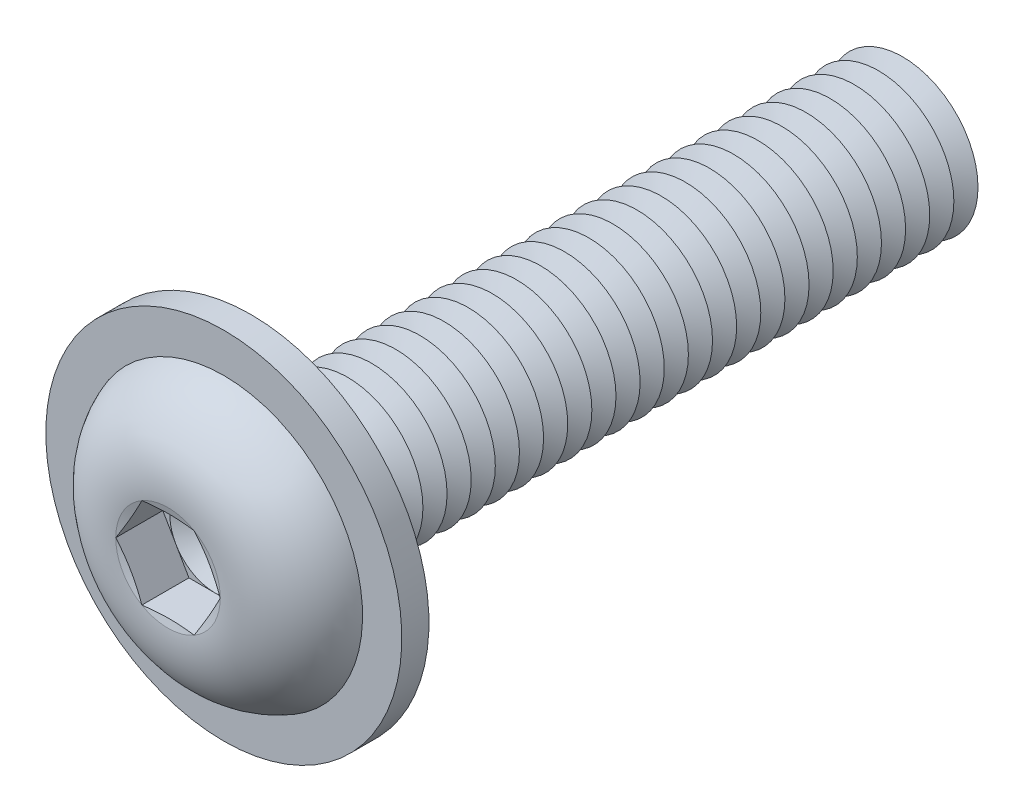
ISO-10303-21;
HEADER;
FILE_DESCRIPTION(('STEP AP214'),'2;1');
FILE_NAME('part.step','',(''),(''),'','','');
FILE_SCHEMA(('AUTOMOTIVE_DESIGN { 1 0 10303 214 1 1 1 1 }'));
ENDSEC;
DATA;
#1=APPLICATION_CONTEXT('core data for automotive mechanical design processes');
#2=APPLICATION_PROTOCOL_DEFINITION('international standard','automotive_design',2000,#1);
#3=PRODUCT_CONTEXT('',#1,'mechanical');
#4=PRODUCT('Part','Part','',(#3));
#5=PRODUCT_RELATED_PRODUCT_CATEGORY('part','',(#4));
#6=PRODUCT_DEFINITION_FORMATION('','',#4);
#7=PRODUCT_DEFINITION_CONTEXT('part definition',#1,'design');
#8=PRODUCT_DEFINITION('design','',#6,#7);
#9=PRODUCT_DEFINITION_SHAPE('','',#8);
#10=(LENGTH_UNIT() NAMED_UNIT(*) SI_UNIT(.MILLI.,.METRE.));
#11=(NAMED_UNIT(*) PLANE_ANGLE_UNIT() SI_UNIT($,.RADIAN.));
#12=(NAMED_UNIT(*) SI_UNIT($,.STERADIAN.) SOLID_ANGLE_UNIT());
#13=UNCERTAINTY_MEASURE_WITH_UNIT(LENGTH_MEASURE(1.E-05),#10,'distance_accuracy_value','');
#14=(GEOMETRIC_REPRESENTATION_CONTEXT(3) GLOBAL_UNCERTAINTY_ASSIGNED_CONTEXT((#13)) GLOBAL_UNIT_ASSIGNED_CONTEXT((#10,
#11,#12)) REPRESENTATION_CONTEXT('',''));
#15=CARTESIAN_POINT('',(0.,0.,0.));
#16=DIRECTION('',(0.,0.,1.));
#17=DIRECTION('',(1.,0.,0.));
#18=AXIS2_PLACEMENT_3D('',#15,#16,#17);
#19=CARTESIAN_POINT('',(0.,0.,-19.2));
#20=DIRECTION('',(0.,0.,1.));
#21=DIRECTION('',(1.,0.,0.));
#22=AXIS2_PLACEMENT_3D('',#19,#20,#21);
#23=CONICAL_SURFACE('',#22,2.50000000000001,1.0471975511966);
#24=CARTESIAN_POINT('',(0.,0.,-19.6));
#25=DIRECTION('',(0.,0.,1.));
#26=DIRECTION('',(1.,0.,0.));
#27=AXIS2_PLACEMENT_3D('',#24,#25,#26);
#28=CIRCLE('',#27,1.80717967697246);
#29=CARTESIAN_POINT('',(1.80717967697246,0.,-19.6));
#30=VERTEX_POINT('',#29);
#31=EDGE_CURVE('E426',#30,#30,#28,.T.);
#32=ORIENTED_EDGE('',*,*,#31,.T.);
#33=EDGE_LOOP('',(#32));
#34=FACE_BOUND('',#33,.T.);
#35=CARTESIAN_POINT('',(0.,0.,-19.2));
#36=DIRECTION('',(0.,0.,1.));
#37=DIRECTION('',(1.,0.,0.));
#38=AXIS2_PLACEMENT_3D('',#35,#36,#37);
#39=CIRCLE('',#38,2.50000000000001);
#40=CARTESIAN_POINT('',(2.50000000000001,0.,-19.2));
#41=VERTEX_POINT('',#40);
#42=EDGE_CURVE('E422',#41,#41,#39,.T.);
#43=ORIENTED_EDGE('',*,*,#42,.F.);
#44=EDGE_LOOP('',(#43));
#45=FACE_BOUND('',#44,.T.);
#46=ADVANCED_FACE('F39',(#34,#45),#23,.T.);
#47=CARTESIAN_POINT('',(0.,0.,-19.6));
#48=DIRECTION('',(0.,0.,-1.));
#49=DIRECTION('',(-1.,0.,0.));
#50=AXIS2_PLACEMENT_3D('',#47,#48,#49);
#51=CONICAL_SURFACE('',#50,1.80717967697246,1.0471975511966);
#52=CARTESIAN_POINT('',(0.,0.,-20.));
#53=DIRECTION('',(0.,0.,1.));
#54=DIRECTION('',(1.,0.,0.));
#55=AXIS2_PLACEMENT_3D('',#52,#53,#54);
#56=CIRCLE('',#55,2.50000000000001);
#57=CARTESIAN_POINT('',(2.50000000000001,0.,-20.));
#58=VERTEX_POINT('',#57);
#59=EDGE_CURVE('E430',#58,#58,#56,.T.);
#60=ORIENTED_EDGE('',*,*,#59,.T.);
#61=EDGE_LOOP('',(#60));
#62=FACE_BOUND('',#61,.T.);
#63=ORIENTED_EDGE('',*,*,#31,.F.);
#64=EDGE_LOOP('',(#63));
#65=FACE_BOUND('',#64,.T.);
#66=ADVANCED_FACE('F552',(#62,#65),#51,.T.);
#67=CARTESIAN_POINT('',(0.,2.50000000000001,-22.));
#68=DIRECTION('',(0.,0.,-1.));
#69=DIRECTION('',(-1.,0.,0.));
#70=AXIS2_PLACEMENT_3D('',#67,#68,#69);
#71=PLANE('',#70);
#72=CARTESIAN_POINT('',(0.,0.,-22.));
#73=DIRECTION('',(0.,0.,1.));
#74=DIRECTION('',(1.,0.,0.));
#75=AXIS2_PLACEMENT_3D('',#72,#73,#74);
#76=CIRCLE('',#75,1.80717967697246);
#77=CARTESIAN_POINT('',(1.80717967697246,0.,-22.));
#78=VERTEX_POINT('',#77);
#79=EDGE_CURVE('E450',#78,#78,#76,.T.);
#80=ORIENTED_EDGE('',*,*,#79,.F.);
#81=EDGE_LOOP('',(#80));
#82=FACE_BOUND('',#81,.T.);
#83=ADVANCED_FACE('F558',(#82),#71,.T.);
#84=CARTESIAN_POINT('',(0.,0.,-21.6));
#85=DIRECTION('',(0.,0.,1.));
#86=DIRECTION('',(1.,0.,0.));
#87=AXIS2_PLACEMENT_3D('',#84,#85,#86);
#88=CONICAL_SURFACE('',#87,2.50000000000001,1.0471975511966);
#89=ORIENTED_EDGE('',*,*,#79,.T.);
#90=EDGE_LOOP('',(#89));
#91=FACE_BOUND('',#90,.T.);
#92=CARTESIAN_POINT('',(0.,0.,-21.6));
#93=DIRECTION('',(0.,0.,1.));
#94=DIRECTION('',(1.,0.,0.));
#95=AXIS2_PLACEMENT_3D('',#92,#93,#94);
#96=CIRCLE('',#95,2.50000000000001);
#97=CARTESIAN_POINT('',(2.50000000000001,0.,-21.6));
#98=VERTEX_POINT('',#97);
#99=EDGE_CURVE('E446',#98,#98,#96,.T.);
#100=ORIENTED_EDGE('',*,*,#99,.F.);
#101=EDGE_LOOP('',(#100));
#102=FACE_BOUND('',#101,.T.);
#103=ADVANCED_FACE('F577',(#91,#102),#88,.T.);
#104=CARTESIAN_POINT('',(0.,0.,-21.2));
#105=DIRECTION('',(0.,0.,-1.));
#106=DIRECTION('',(-1.,0.,0.));
#107=AXIS2_PLACEMENT_3D('',#104,#105,#106);
#108=CONICAL_SURFACE('',#107,1.80717967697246,1.0471975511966);
#109=ORIENTED_EDGE('',*,*,#99,.T.);
#110=EDGE_LOOP('',(#109));
#111=FACE_BOUND('',#110,.T.);
#112=CARTESIAN_POINT('',(0.,0.,-21.2));
#113=DIRECTION('',(0.,0.,1.));
#114=DIRECTION('',(1.,0.,0.));
#115=AXIS2_PLACEMENT_3D('',#112,#113,#114);
#116=CIRCLE('',#115,1.80717967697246);
#117=CARTESIAN_POINT('',(1.80717967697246,0.,-21.2));
#118=VERTEX_POINT('',#117);
#119=EDGE_CURVE('E442',#118,#118,#116,.T.);
#120=ORIENTED_EDGE('',*,*,#119,.F.);
#121=EDGE_LOOP('',(#120));
#122=FACE_BOUND('',#121,.T.);
#123=ADVANCED_FACE('F574',(#111,#122),#108,.T.);
#124=CARTESIAN_POINT('',(0.,0.,-20.8));
#125=DIRECTION('',(0.,0.,1.));
#126=DIRECTION('',(1.,0.,0.));
#127=AXIS2_PLACEMENT_3D('',#124,#125,#126);
#128=CONICAL_SURFACE('',#127,2.50000000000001,1.0471975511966);
#129=ORIENTED_EDGE('',*,*,#119,.T.);
#130=EDGE_LOOP('',(#129));
#131=FACE_BOUND('',#130,.T.);
#132=CARTESIAN_POINT('',(0.,0.,-20.8));
#133=DIRECTION('',(0.,0.,1.));
#134=DIRECTION('',(1.,0.,0.));
#135=AXIS2_PLACEMENT_3D('',#132,#133,#134);
#136=CIRCLE('',#135,2.50000000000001);
#137=CARTESIAN_POINT('',(2.50000000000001,0.,-20.8));
#138=VERTEX_POINT('',#137);
#139=EDGE_CURVE('E438',#138,#138,#136,.T.);
#140=ORIENTED_EDGE('',*,*,#139,.F.);
#141=EDGE_LOOP('',(#140));
#142=FACE_BOUND('',#141,.T.);
#143=ADVANCED_FACE('F568',(#131,#142),#128,.T.);
#144=CARTESIAN_POINT('',(0.,0.,-20.4));
#145=DIRECTION('',(0.,0.,-1.));
#146=DIRECTION('',(-1.,0.,0.));
#147=AXIS2_PLACEMENT_3D('',#144,#145,#146);
#148=CONICAL_SURFACE('',#147,1.80717967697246,1.0471975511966);
#149=ORIENTED_EDGE('',*,*,#139,.T.);
#150=EDGE_LOOP('',(#149));
#151=FACE_BOUND('',#150,.T.);
#152=CARTESIAN_POINT('',(0.,0.,-20.4));
#153=DIRECTION('',(0.,0.,1.));
#154=DIRECTION('',(1.,0.,0.));
#155=AXIS2_PLACEMENT_3D('',#152,#153,#154);
#156=CIRCLE('',#155,1.80717967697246);
#157=CARTESIAN_POINT('',(1.80717967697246,0.,-20.4));
#158=VERTEX_POINT('',#157);
#159=EDGE_CURVE('E434',#158,#158,#156,.T.);
#160=ORIENTED_EDGE('',*,*,#159,.F.);
#161=EDGE_LOOP('',(#160));
#162=FACE_BOUND('',#161,.T.);
#163=ADVANCED_FACE('F564',(#151,#162),#148,.T.);
#164=CARTESIAN_POINT('',(0.,0.,-20.));
#165=DIRECTION('',(0.,0.,1.));
#166=DIRECTION('',(1.,0.,0.));
#167=AXIS2_PLACEMENT_3D('',#164,#165,#166);
#168=CONICAL_SURFACE('',#167,2.50000000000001,1.0471975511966);
#169=ORIENTED_EDGE('',*,*,#159,.T.);
#170=EDGE_LOOP('',(#169));
#171=FACE_BOUND('',#170,.T.);
#172=ORIENTED_EDGE('',*,*,#59,.F.);
#173=EDGE_LOOP('',(#172));
#174=FACE_BOUND('',#173,.T.);
#175=ADVANCED_FACE('F567',(#171,#174),#168,.T.);
#176=CARTESIAN_POINT('',(0.,0.,-18.4));
#177=DIRECTION('',(0.,0.,1.));
#178=DIRECTION('',(1.,0.,0.));
#179=AXIS2_PLACEMENT_3D('',#176,#177,#178);
#180=CONICAL_SURFACE('',#179,2.50000000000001,1.0471975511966);
#181=CARTESIAN_POINT('',(0.,0.,-18.8));
#182=DIRECTION('',(0.,0.,1.));
#183=DIRECTION('',(1.,0.,0.));
#184=AXIS2_PLACEMENT_3D('',#181,#182,#183);
#185=CIRCLE('',#184,1.80717967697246);
#186=CARTESIAN_POINT('',(1.80717967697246,0.,-18.8));
#187=VERTEX_POINT('',#186);
#188=EDGE_CURVE('E418',#187,#187,#185,.T.);
#189=ORIENTED_EDGE('',*,*,#188,.T.);
#190=EDGE_LOOP('',(#189));
#191=FACE_BOUND('',#190,.T.);
#192=CARTESIAN_POINT('',(0.,0.,-18.4));
#193=DIRECTION('',(0.,0.,1.));
#194=DIRECTION('',(1.,0.,0.));
#195=AXIS2_PLACEMENT_3D('',#192,#193,#194);
#196=CIRCLE('',#195,2.50000000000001);
#197=CARTESIAN_POINT('',(2.50000000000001,0.,-18.4));
#198=VERTEX_POINT('',#197);
#199=EDGE_CURVE('E414',#198,#198,#196,.T.);
#200=ORIENTED_EDGE('',*,*,#199,.F.);
#201=EDGE_LOOP('',(#200));
#202=FACE_BOUND('',#201,.T.);
#203=ADVANCED_FACE('F572',(#191,#202),#180,.T.);
#204=CARTESIAN_POINT('',(0.,0.,-18.8));
#205=DIRECTION('',(0.,0.,-1.));
#206=DIRECTION('',(-1.,0.,0.));
#207=AXIS2_PLACEMENT_3D('',#204,#205,#206);
#208=CONICAL_SURFACE('',#207,1.80717967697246,1.0471975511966);
#209=ORIENTED_EDGE('',*,*,#42,.T.);
#210=EDGE_LOOP('',(#209));
#211=FACE_BOUND('',#210,.T.);
#212=ORIENTED_EDGE('',*,*,#188,.F.);
#213=EDGE_LOOP('',(#212));
#214=FACE_BOUND('',#213,.T.);
#215=ADVANCED_FACE('F623',(#211,#214),#208,.T.);
#216=CARTESIAN_POINT('',(0.,0.,-17.6));
#217=DIRECTION('',(0.,0.,1.));
#218=DIRECTION('',(1.,0.,0.));
#219=AXIS2_PLACEMENT_3D('',#216,#217,#218);
#220=CONICAL_SURFACE('',#219,2.50000000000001,1.0471975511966);
#221=CARTESIAN_POINT('',(0.,0.,-18.));
#222=DIRECTION('',(0.,0.,1.));
#223=DIRECTION('',(1.,0.,0.));
#224=AXIS2_PLACEMENT_3D('',#221,#222,#223);
#225=CIRCLE('',#224,1.80717967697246);
#226=CARTESIAN_POINT('',(1.80717967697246,0.,-18.));
#227=VERTEX_POINT('',#226);
#228=EDGE_CURVE('E410',#227,#227,#225,.T.);
#229=ORIENTED_EDGE('',*,*,#228,.T.);
#230=EDGE_LOOP('',(#229));
#231=FACE_BOUND('',#230,.T.);
#232=CARTESIAN_POINT('',(0.,0.,-17.6));
#233=DIRECTION('',(0.,0.,1.));
#234=DIRECTION('',(1.,0.,0.));
#235=AXIS2_PLACEMENT_3D('',#232,#233,#234);
#236=CIRCLE('',#235,2.50000000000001);
#237=CARTESIAN_POINT('',(2.50000000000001,0.,-17.6));
#238=VERTEX_POINT('',#237);
#239=EDGE_CURVE('E406',#238,#238,#236,.T.);
#240=ORIENTED_EDGE('',*,*,#239,.F.);
#241=EDGE_LOOP('',(#240));
#242=FACE_BOUND('',#241,.T.);
#243=ADVANCED_FACE('F629',(#231,#242),#220,.T.);
#244=CARTESIAN_POINT('',(0.,0.,-18.));
#245=DIRECTION('',(0.,0.,-1.));
#246=DIRECTION('',(-1.,0.,0.));
#247=AXIS2_PLACEMENT_3D('',#244,#245,#246);
#248=CONICAL_SURFACE('',#247,1.80717967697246,1.0471975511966);
#249=ORIENTED_EDGE('',*,*,#199,.T.);
#250=EDGE_LOOP('',(#249));
#251=FACE_BOUND('',#250,.T.);
#252=ORIENTED_EDGE('',*,*,#228,.F.);
#253=EDGE_LOOP('',(#252));
#254=FACE_BOUND('',#253,.T.);
#255=ADVANCED_FACE('F636',(#251,#254),#248,.T.);
#256=CARTESIAN_POINT('',(0.,0.,-16.8));
#257=DIRECTION('',(0.,0.,1.));
#258=DIRECTION('',(1.,0.,0.));
#259=AXIS2_PLACEMENT_3D('',#256,#257,#258);
#260=CONICAL_SURFACE('',#259,2.50000000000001,1.0471975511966);
#261=CARTESIAN_POINT('',(0.,0.,-17.2));
#262=DIRECTION('',(0.,0.,1.));
#263=DIRECTION('',(1.,0.,0.));
#264=AXIS2_PLACEMENT_3D('',#261,#262,#263);
#265=CIRCLE('',#264,1.80717967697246);
#266=CARTESIAN_POINT('',(1.80717967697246,0.,-17.2));
#267=VERTEX_POINT('',#266);
#268=EDGE_CURVE('E402',#267,#267,#265,.T.);
#269=ORIENTED_EDGE('',*,*,#268,.T.);
#270=EDGE_LOOP('',(#269));
#271=FACE_BOUND('',#270,.T.);
#272=CARTESIAN_POINT('',(0.,0.,-16.8));
#273=DIRECTION('',(0.,0.,1.));
#274=DIRECTION('',(1.,0.,0.));
#275=AXIS2_PLACEMENT_3D('',#272,#273,#274);
#276=CIRCLE('',#275,2.50000000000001);
#277=CARTESIAN_POINT('',(2.50000000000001,0.,-16.8));
#278=VERTEX_POINT('',#277);
#279=EDGE_CURVE('E398',#278,#278,#276,.T.);
#280=ORIENTED_EDGE('',*,*,#279,.F.);
#281=EDGE_LOOP('',(#280));
#282=FACE_BOUND('',#281,.T.);
#283=ADVANCED_FACE('F643',(#271,#282),#260,.T.);
#284=CARTESIAN_POINT('',(0.,0.,-17.2));
#285=DIRECTION('',(0.,0.,-1.));
#286=DIRECTION('',(-1.,0.,0.));
#287=AXIS2_PLACEMENT_3D('',#284,#285,#286);
#288=CONICAL_SURFACE('',#287,1.80717967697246,1.0471975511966);
#289=ORIENTED_EDGE('',*,*,#239,.T.);
#290=EDGE_LOOP('',(#289));
#291=FACE_BOUND('',#290,.T.);
#292=ORIENTED_EDGE('',*,*,#268,.F.);
#293=EDGE_LOOP('',(#292));
#294=FACE_BOUND('',#293,.T.);
#295=ADVANCED_FACE('F650',(#291,#294),#288,.T.);
#296=CARTESIAN_POINT('',(0.,0.,-16.));
#297=DIRECTION('',(0.,0.,1.));
#298=DIRECTION('',(1.,0.,0.));
#299=AXIS2_PLACEMENT_3D('',#296,#297,#298);
#300=CONICAL_SURFACE('',#299,2.50000000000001,1.0471975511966);
#301=CARTESIAN_POINT('',(0.,0.,-16.4));
#302=DIRECTION('',(0.,0.,1.));
#303=DIRECTION('',(1.,0.,0.));
#304=AXIS2_PLACEMENT_3D('',#301,#302,#303);
#305=CIRCLE('',#304,1.80717967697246);
#306=CARTESIAN_POINT('',(1.80717967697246,0.,-16.4));
#307=VERTEX_POINT('',#306);
#308=EDGE_CURVE('E394',#307,#307,#305,.T.);
#309=ORIENTED_EDGE('',*,*,#308,.T.);
#310=EDGE_LOOP('',(#309));
#311=FACE_BOUND('',#310,.T.);
#312=CARTESIAN_POINT('',(0.,0.,-16.));
#313=DIRECTION('',(0.,0.,1.));
#314=DIRECTION('',(1.,0.,0.));
#315=AXIS2_PLACEMENT_3D('',#312,#313,#314);
#316=CIRCLE('',#315,2.50000000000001);
#317=CARTESIAN_POINT('',(2.50000000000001,0.,-16.));
#318=VERTEX_POINT('',#317);
#319=EDGE_CURVE('E390',#318,#318,#316,.T.);
#320=ORIENTED_EDGE('',*,*,#319,.F.);
#321=EDGE_LOOP('',(#320));
#322=FACE_BOUND('',#321,.T.);
#323=ADVANCED_FACE('F657',(#311,#322),#300,.T.);
#324=CARTESIAN_POINT('',(0.,0.,-16.4));
#325=DIRECTION('',(0.,0.,-1.));
#326=DIRECTION('',(-1.,0.,0.));
#327=AXIS2_PLACEMENT_3D('',#324,#325,#326);
#328=CONICAL_SURFACE('',#327,1.80717967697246,1.0471975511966);
#329=ORIENTED_EDGE('',*,*,#279,.T.);
#330=EDGE_LOOP('',(#329));
#331=FACE_BOUND('',#330,.T.);
#332=ORIENTED_EDGE('',*,*,#308,.F.);
#333=EDGE_LOOP('',(#332));
#334=FACE_BOUND('',#333,.T.);
#335=ADVANCED_FACE('F664',(#331,#334),#328,.T.);
#336=CARTESIAN_POINT('',(0.,0.,-15.2));
#337=DIRECTION('',(0.,0.,1.));
#338=DIRECTION('',(1.,0.,0.));
#339=AXIS2_PLACEMENT_3D('',#336,#337,#338);
#340=CONICAL_SURFACE('',#339,2.50000000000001,1.0471975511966);
#341=CARTESIAN_POINT('',(0.,0.,-15.6));
#342=DIRECTION('',(0.,0.,1.));
#343=DIRECTION('',(1.,0.,0.));
#344=AXIS2_PLACEMENT_3D('',#341,#342,#343);
#345=CIRCLE('',#344,1.80717967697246);
#346=CARTESIAN_POINT('',(1.80717967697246,0.,-15.6));
#347=VERTEX_POINT('',#346);
#348=EDGE_CURVE('E386',#347,#347,#345,.T.);
#349=ORIENTED_EDGE('',*,*,#348,.T.);
#350=EDGE_LOOP('',(#349));
#351=FACE_BOUND('',#350,.T.);
#352=CARTESIAN_POINT('',(0.,0.,-15.2));
#353=DIRECTION('',(0.,0.,1.));
#354=DIRECTION('',(1.,0.,0.));
#355=AXIS2_PLACEMENT_3D('',#352,#353,#354);
#356=CIRCLE('',#355,2.50000000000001);
#357=CARTESIAN_POINT('',(2.50000000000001,0.,-15.2));
#358=VERTEX_POINT('',#357);
#359=EDGE_CURVE('E382',#358,#358,#356,.T.);
#360=ORIENTED_EDGE('',*,*,#359,.F.);
#361=EDGE_LOOP('',(#360));
#362=FACE_BOUND('',#361,.T.);
#363=ADVANCED_FACE('F671',(#351,#362),#340,.T.);
#364=CARTESIAN_POINT('',(0.,0.,-15.6));
#365=DIRECTION('',(0.,0.,-1.));
#366=DIRECTION('',(-1.,0.,0.));
#367=AXIS2_PLACEMENT_3D('',#364,#365,#366);
#368=CONICAL_SURFACE('',#367,1.80717967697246,1.0471975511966);
#369=ORIENTED_EDGE('',*,*,#319,.T.);
#370=EDGE_LOOP('',(#369));
#371=FACE_BOUND('',#370,.T.);
#372=ORIENTED_EDGE('',*,*,#348,.F.);
#373=EDGE_LOOP('',(#372));
#374=FACE_BOUND('',#373,.T.);
#375=ADVANCED_FACE('F678',(#371,#374),#368,.T.);
#376=CARTESIAN_POINT('',(0.,0.,-14.4));
#377=DIRECTION('',(0.,0.,1.));
#378=DIRECTION('',(1.,0.,0.));
#379=AXIS2_PLACEMENT_3D('',#376,#377,#378);
#380=CONICAL_SURFACE('',#379,2.50000000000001,1.0471975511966);
#381=CARTESIAN_POINT('',(0.,0.,-14.8));
#382=DIRECTION('',(0.,0.,1.));
#383=DIRECTION('',(1.,0.,0.));
#384=AXIS2_PLACEMENT_3D('',#381,#382,#383);
#385=CIRCLE('',#384,1.80717967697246);
#386=CARTESIAN_POINT('',(1.80717967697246,0.,-14.8));
#387=VERTEX_POINT('',#386);
#388=EDGE_CURVE('E378',#387,#387,#385,.T.);
#389=ORIENTED_EDGE('',*,*,#388,.T.);
#390=EDGE_LOOP('',(#389));
#391=FACE_BOUND('',#390,.T.);
#392=CARTESIAN_POINT('',(0.,0.,-14.4));
#393=DIRECTION('',(0.,0.,1.));
#394=DIRECTION('',(1.,0.,0.));
#395=AXIS2_PLACEMENT_3D('',#392,#393,#394);
#396=CIRCLE('',#395,2.50000000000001);
#397=CARTESIAN_POINT('',(2.50000000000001,0.,-14.4));
#398=VERTEX_POINT('',#397);
#399=EDGE_CURVE('E374',#398,#398,#396,.T.);
#400=ORIENTED_EDGE('',*,*,#399,.F.);
#401=EDGE_LOOP('',(#400));
#402=FACE_BOUND('',#401,.T.);
#403=ADVANCED_FACE('F685',(#391,#402),#380,.T.);
#404=CARTESIAN_POINT('',(0.,0.,-14.8));
#405=DIRECTION('',(0.,0.,-1.));
#406=DIRECTION('',(-1.,0.,0.));
#407=AXIS2_PLACEMENT_3D('',#404,#405,#406);
#408=CONICAL_SURFACE('',#407,1.80717967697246,1.0471975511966);
#409=ORIENTED_EDGE('',*,*,#359,.T.);
#410=EDGE_LOOP('',(#409));
#411=FACE_BOUND('',#410,.T.);
#412=ORIENTED_EDGE('',*,*,#388,.F.);
#413=EDGE_LOOP('',(#412));
#414=FACE_BOUND('',#413,.T.);
#415=ADVANCED_FACE('F692',(#411,#414),#408,.T.);
#416=CARTESIAN_POINT('',(0.,0.,-13.6));
#417=DIRECTION('',(0.,0.,1.));
#418=DIRECTION('',(1.,0.,0.));
#419=AXIS2_PLACEMENT_3D('',#416,#417,#418);
#420=CONICAL_SURFACE('',#419,2.50000000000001,1.0471975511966);
#421=CARTESIAN_POINT('',(0.,0.,-14.));
#422=DIRECTION('',(0.,0.,1.));
#423=DIRECTION('',(1.,0.,0.));
#424=AXIS2_PLACEMENT_3D('',#421,#422,#423);
#425=CIRCLE('',#424,1.80717967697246);
#426=CARTESIAN_POINT('',(1.80717967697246,0.,-14.));
#427=VERTEX_POINT('',#426);
#428=EDGE_CURVE('E370',#427,#427,#425,.T.);
#429=ORIENTED_EDGE('',*,*,#428,.T.);
#430=EDGE_LOOP('',(#429));
#431=FACE_BOUND('',#430,.T.);
#432=CARTESIAN_POINT('',(0.,0.,-13.6));
#433=DIRECTION('',(0.,0.,1.));
#434=DIRECTION('',(1.,0.,0.));
#435=AXIS2_PLACEMENT_3D('',#432,#433,#434);
#436=CIRCLE('',#435,2.50000000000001);
#437=CARTESIAN_POINT('',(2.50000000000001,0.,-13.6));
#438=VERTEX_POINT('',#437);
#439=EDGE_CURVE('E366',#438,#438,#436,.T.);
#440=ORIENTED_EDGE('',*,*,#439,.F.);
#441=EDGE_LOOP('',(#440));
#442=FACE_BOUND('',#441,.T.);
#443=ADVANCED_FACE('F699',(#431,#442),#420,.T.);
#444=CARTESIAN_POINT('',(0.,0.,-14.));
#445=DIRECTION('',(0.,0.,-1.));
#446=DIRECTION('',(-1.,0.,0.));
#447=AXIS2_PLACEMENT_3D('',#444,#445,#446);
#448=CONICAL_SURFACE('',#447,1.80717967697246,1.0471975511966);
#449=ORIENTED_EDGE('',*,*,#399,.T.);
#450=EDGE_LOOP('',(#449));
#451=FACE_BOUND('',#450,.T.);
#452=ORIENTED_EDGE('',*,*,#428,.F.);
#453=EDGE_LOOP('',(#452));
#454=FACE_BOUND('',#453,.T.);
#455=ADVANCED_FACE('F706',(#451,#454),#448,.T.);
#456=CARTESIAN_POINT('',(0.,0.,-12.8));
#457=DIRECTION('',(0.,0.,1.));
#458=DIRECTION('',(1.,0.,0.));
#459=AXIS2_PLACEMENT_3D('',#456,#457,#458);
#460=CONICAL_SURFACE('',#459,2.50000000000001,1.0471975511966);
#461=CARTESIAN_POINT('',(0.,0.,-13.2));
#462=DIRECTION('',(0.,0.,1.));
#463=DIRECTION('',(1.,0.,0.));
#464=AXIS2_PLACEMENT_3D('',#461,#462,#463);
#465=CIRCLE('',#464,1.80717967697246);
#466=CARTESIAN_POINT('',(1.80717967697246,0.,-13.2));
#467=VERTEX_POINT('',#466);
#468=EDGE_CURVE('E362',#467,#467,#465,.T.);
#469=ORIENTED_EDGE('',*,*,#468,.T.);
#470=EDGE_LOOP('',(#469));
#471=FACE_BOUND('',#470,.T.);
#472=CARTESIAN_POINT('',(0.,0.,-12.8));
#473=DIRECTION('',(0.,0.,1.));
#474=DIRECTION('',(1.,0.,0.));
#475=AXIS2_PLACEMENT_3D('',#472,#473,#474);
#476=CIRCLE('',#475,2.50000000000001);
#477=CARTESIAN_POINT('',(2.50000000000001,0.,-12.8));
#478=VERTEX_POINT('',#477);
#479=EDGE_CURVE('E358',#478,#478,#476,.T.);
#480=ORIENTED_EDGE('',*,*,#479,.F.);
#481=EDGE_LOOP('',(#480));
#482=FACE_BOUND('',#481,.T.);
#483=ADVANCED_FACE('F713',(#471,#482),#460,.T.);
#484=CARTESIAN_POINT('',(0.,0.,-13.2));
#485=DIRECTION('',(0.,0.,-1.));
#486=DIRECTION('',(-1.,0.,0.));
#487=AXIS2_PLACEMENT_3D('',#484,#485,#486);
#488=CONICAL_SURFACE('',#487,1.80717967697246,1.0471975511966);
#489=ORIENTED_EDGE('',*,*,#439,.T.);
#490=EDGE_LOOP('',(#489));
#491=FACE_BOUND('',#490,.T.);
#492=ORIENTED_EDGE('',*,*,#468,.F.);
#493=EDGE_LOOP('',(#492));
#494=FACE_BOUND('',#493,.T.);
#495=ADVANCED_FACE('F720',(#491,#494),#488,.T.);
#496=CARTESIAN_POINT('',(0.,0.,-12.));
#497=DIRECTION('',(0.,0.,1.));
#498=DIRECTION('',(1.,0.,0.));
#499=AXIS2_PLACEMENT_3D('',#496,#497,#498);
#500=CONICAL_SURFACE('',#499,2.50000000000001,1.0471975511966);
#501=CARTESIAN_POINT('',(0.,0.,-12.4));
#502=DIRECTION('',(0.,0.,1.));
#503=DIRECTION('',(1.,0.,0.));
#504=AXIS2_PLACEMENT_3D('',#501,#502,#503);
#505=CIRCLE('',#504,1.80717967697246);
#506=CARTESIAN_POINT('',(1.80717967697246,0.,-12.4));
#507=VERTEX_POINT('',#506);
#508=EDGE_CURVE('E354',#507,#507,#505,.T.);
#509=ORIENTED_EDGE('',*,*,#508,.T.);
#510=EDGE_LOOP('',(#509));
#511=FACE_BOUND('',#510,.T.);
#512=CARTESIAN_POINT('',(0.,0.,-12.));
#513=DIRECTION('',(0.,0.,1.));
#514=DIRECTION('',(1.,0.,0.));
#515=AXIS2_PLACEMENT_3D('',#512,#513,#514);
#516=CIRCLE('',#515,2.50000000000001);
#517=CARTESIAN_POINT('',(2.50000000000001,0.,-12.));
#518=VERTEX_POINT('',#517);
#519=EDGE_CURVE('E350',#518,#518,#516,.T.);
#520=ORIENTED_EDGE('',*,*,#519,.F.);
#521=EDGE_LOOP('',(#520));
#522=FACE_BOUND('',#521,.T.);
#523=ADVANCED_FACE('F727',(#511,#522),#500,.T.);
#524=CARTESIAN_POINT('',(0.,0.,-12.4));
#525=DIRECTION('',(0.,0.,-1.));
#526=DIRECTION('',(-1.,0.,0.));
#527=AXIS2_PLACEMENT_3D('',#524,#525,#526);
#528=CONICAL_SURFACE('',#527,1.80717967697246,1.0471975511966);
#529=ORIENTED_EDGE('',*,*,#479,.T.);
#530=EDGE_LOOP('',(#529));
#531=FACE_BOUND('',#530,.T.);
#532=ORIENTED_EDGE('',*,*,#508,.F.);
#533=EDGE_LOOP('',(#532));
#534=FACE_BOUND('',#533,.T.);
#535=ADVANCED_FACE('F734',(#531,#534),#528,.T.);
#536=CARTESIAN_POINT('',(0.,0.,-11.2));
#537=DIRECTION('',(0.,0.,1.));
#538=DIRECTION('',(1.,0.,0.));
#539=AXIS2_PLACEMENT_3D('',#536,#537,#538);
#540=CONICAL_SURFACE('',#539,2.50000000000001,1.0471975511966);
#541=CARTESIAN_POINT('',(0.,0.,-11.6));
#542=DIRECTION('',(0.,0.,1.));
#543=DIRECTION('',(1.,0.,0.));
#544=AXIS2_PLACEMENT_3D('',#541,#542,#543);
#545=CIRCLE('',#544,1.80717967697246);
#546=CARTESIAN_POINT('',(1.80717967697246,0.,-11.6));
#547=VERTEX_POINT('',#546);
#548=EDGE_CURVE('E346',#547,#547,#545,.T.);
#549=ORIENTED_EDGE('',*,*,#548,.T.);
#550=EDGE_LOOP('',(#549));
#551=FACE_BOUND('',#550,.T.);
#552=CARTESIAN_POINT('',(0.,0.,-11.2));
#553=DIRECTION('',(0.,0.,1.));
#554=DIRECTION('',(1.,0.,0.));
#555=AXIS2_PLACEMENT_3D('',#552,#553,#554);
#556=CIRCLE('',#555,2.50000000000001);
#557=CARTESIAN_POINT('',(2.50000000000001,0.,-11.2));
#558=VERTEX_POINT('',#557);
#559=EDGE_CURVE('E342',#558,#558,#556,.T.);
#560=ORIENTED_EDGE('',*,*,#559,.F.);
#561=EDGE_LOOP('',(#560));
#562=FACE_BOUND('',#561,.T.);
#563=ADVANCED_FACE('F741',(#551,#562),#540,.T.);
#564=CARTESIAN_POINT('',(0.,0.,-11.6));
#565=DIRECTION('',(0.,0.,-1.));
#566=DIRECTION('',(-1.,0.,0.));
#567=AXIS2_PLACEMENT_3D('',#564,#565,#566);
#568=CONICAL_SURFACE('',#567,1.80717967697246,1.0471975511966);
#569=ORIENTED_EDGE('',*,*,#519,.T.);
#570=EDGE_LOOP('',(#569));
#571=FACE_BOUND('',#570,.T.);
#572=ORIENTED_EDGE('',*,*,#548,.F.);
#573=EDGE_LOOP('',(#572));
#574=FACE_BOUND('',#573,.T.);
#575=ADVANCED_FACE('F748',(#571,#574),#568,.T.);
#576=CARTESIAN_POINT('',(0.,0.,-10.4));
#577=DIRECTION('',(0.,0.,1.));
#578=DIRECTION('',(1.,0.,0.));
#579=AXIS2_PLACEMENT_3D('',#576,#577,#578);
#580=CONICAL_SURFACE('',#579,2.50000000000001,1.0471975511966);
#581=CARTESIAN_POINT('',(0.,0.,-10.8));
#582=DIRECTION('',(0.,0.,1.));
#583=DIRECTION('',(1.,0.,0.));
#584=AXIS2_PLACEMENT_3D('',#581,#582,#583);
#585=CIRCLE('',#584,1.80717967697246);
#586=CARTESIAN_POINT('',(1.80717967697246,0.,-10.8));
#587=VERTEX_POINT('',#586);
#588=EDGE_CURVE('E338',#587,#587,#585,.T.);
#589=ORIENTED_EDGE('',*,*,#588,.T.);
#590=EDGE_LOOP('',(#589));
#591=FACE_BOUND('',#590,.T.);
#592=CARTESIAN_POINT('',(0.,0.,-10.4));
#593=DIRECTION('',(0.,0.,1.));
#594=DIRECTION('',(1.,0.,0.));
#595=AXIS2_PLACEMENT_3D('',#592,#593,#594);
#596=CIRCLE('',#595,2.50000000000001);
#597=CARTESIAN_POINT('',(2.50000000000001,0.,-10.4));
#598=VERTEX_POINT('',#597);
#599=EDGE_CURVE('E334',#598,#598,#596,.T.);
#600=ORIENTED_EDGE('',*,*,#599,.F.);
#601=EDGE_LOOP('',(#600));
#602=FACE_BOUND('',#601,.T.);
#603=ADVANCED_FACE('F755',(#591,#602),#580,.T.);
#604=CARTESIAN_POINT('',(0.,0.,-10.8));
#605=DIRECTION('',(0.,0.,-1.));
#606=DIRECTION('',(-1.,0.,0.));
#607=AXIS2_PLACEMENT_3D('',#604,#605,#606);
#608=CONICAL_SURFACE('',#607,1.80717967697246,1.0471975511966);
#609=ORIENTED_EDGE('',*,*,#559,.T.);
#610=EDGE_LOOP('',(#609));
#611=FACE_BOUND('',#610,.T.);
#612=ORIENTED_EDGE('',*,*,#588,.F.);
#613=EDGE_LOOP('',(#612));
#614=FACE_BOUND('',#613,.T.);
#615=ADVANCED_FACE('F762',(#611,#614),#608,.T.);
#616=CARTESIAN_POINT('',(0.,0.,-9.6));
#617=DIRECTION('',(0.,0.,1.));
#618=DIRECTION('',(1.,0.,0.));
#619=AXIS2_PLACEMENT_3D('',#616,#617,#618);
#620=CONICAL_SURFACE('',#619,2.50000000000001,1.0471975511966);
#621=CARTESIAN_POINT('',(0.,0.,-10.));
#622=DIRECTION('',(0.,0.,1.));
#623=DIRECTION('',(1.,0.,0.));
#624=AXIS2_PLACEMENT_3D('',#621,#622,#623);
#625=CIRCLE('',#624,1.80717967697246);
#626=CARTESIAN_POINT('',(1.80717967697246,0.,-10.));
#627=VERTEX_POINT('',#626);
#628=EDGE_CURVE('E330',#627,#627,#625,.T.);
#629=ORIENTED_EDGE('',*,*,#628,.T.);
#630=EDGE_LOOP('',(#629));
#631=FACE_BOUND('',#630,.T.);
#632=CARTESIAN_POINT('',(0.,0.,-9.6));
#633=DIRECTION('',(0.,0.,1.));
#634=DIRECTION('',(1.,0.,0.));
#635=AXIS2_PLACEMENT_3D('',#632,#633,#634);
#636=CIRCLE('',#635,2.50000000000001);
#637=CARTESIAN_POINT('',(2.50000000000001,0.,-9.6));
#638=VERTEX_POINT('',#637);
#639=EDGE_CURVE('E326',#638,#638,#636,.T.);
#640=ORIENTED_EDGE('',*,*,#639,.F.);
#641=EDGE_LOOP('',(#640));
#642=FACE_BOUND('',#641,.T.);
#643=ADVANCED_FACE('F769',(#631,#642),#620,.T.);
#644=CARTESIAN_POINT('',(0.,0.,-10.));
#645=DIRECTION('',(0.,0.,-1.));
#646=DIRECTION('',(-1.,0.,0.));
#647=AXIS2_PLACEMENT_3D('',#644,#645,#646);
#648=CONICAL_SURFACE('',#647,1.80717967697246,1.0471975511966);
#649=ORIENTED_EDGE('',*,*,#599,.T.);
#650=EDGE_LOOP('',(#649));
#651=FACE_BOUND('',#650,.T.);
#652=ORIENTED_EDGE('',*,*,#628,.F.);
#653=EDGE_LOOP('',(#652));
#654=FACE_BOUND('',#653,.T.);
#655=ADVANCED_FACE('F776',(#651,#654),#648,.T.);
#656=CARTESIAN_POINT('',(0.,0.,-8.8));
#657=DIRECTION('',(0.,0.,1.));
#658=DIRECTION('',(1.,0.,0.));
#659=AXIS2_PLACEMENT_3D('',#656,#657,#658);
#660=CONICAL_SURFACE('',#659,2.50000000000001,1.0471975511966);
#661=CARTESIAN_POINT('',(0.,0.,-9.2));
#662=DIRECTION('',(0.,0.,1.));
#663=DIRECTION('',(1.,0.,0.));
#664=AXIS2_PLACEMENT_3D('',#661,#662,#663);
#665=CIRCLE('',#664,1.80717967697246);
#666=CARTESIAN_POINT('',(1.80717967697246,0.,-9.2));
#667=VERTEX_POINT('',#666);
#668=EDGE_CURVE('E322',#667,#667,#665,.T.);
#669=ORIENTED_EDGE('',*,*,#668,.T.);
#670=EDGE_LOOP('',(#669));
#671=FACE_BOUND('',#670,.T.);
#672=CARTESIAN_POINT('',(0.,0.,-8.8));
#673=DIRECTION('',(0.,0.,1.));
#674=DIRECTION('',(1.,0.,0.));
#675=AXIS2_PLACEMENT_3D('',#672,#673,#674);
#676=CIRCLE('',#675,2.50000000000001);
#677=CARTESIAN_POINT('',(2.50000000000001,0.,-8.8));
#678=VERTEX_POINT('',#677);
#679=EDGE_CURVE('E318',#678,#678,#676,.T.);
#680=ORIENTED_EDGE('',*,*,#679,.F.);
#681=EDGE_LOOP('',(#680));
#682=FACE_BOUND('',#681,.T.);
#683=ADVANCED_FACE('F783',(#671,#682),#660,.T.);
#684=CARTESIAN_POINT('',(0.,0.,-9.2));
#685=DIRECTION('',(0.,0.,-1.));
#686=DIRECTION('',(-1.,0.,0.));
#687=AXIS2_PLACEMENT_3D('',#684,#685,#686);
#688=CONICAL_SURFACE('',#687,1.80717967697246,1.0471975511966);
#689=ORIENTED_EDGE('',*,*,#639,.T.);
#690=EDGE_LOOP('',(#689));
#691=FACE_BOUND('',#690,.T.);
#692=ORIENTED_EDGE('',*,*,#668,.F.);
#693=EDGE_LOOP('',(#692));
#694=FACE_BOUND('',#693,.T.);
#695=ADVANCED_FACE('F790',(#691,#694),#688,.T.);
#696=CARTESIAN_POINT('',(0.,0.,-8.));
#697=DIRECTION('',(0.,0.,1.));
#698=DIRECTION('',(1.,0.,0.));
#699=AXIS2_PLACEMENT_3D('',#696,#697,#698);
#700=CONICAL_SURFACE('',#699,2.50000000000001,1.0471975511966);
#701=CARTESIAN_POINT('',(0.,0.,-8.4));
#702=DIRECTION('',(0.,0.,1.));
#703=DIRECTION('',(1.,0.,0.));
#704=AXIS2_PLACEMENT_3D('',#701,#702,#703);
#705=CIRCLE('',#704,1.80717967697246);
#706=CARTESIAN_POINT('',(1.80717967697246,0.,-8.4));
#707=VERTEX_POINT('',#706);
#708=EDGE_CURVE('E314',#707,#707,#705,.T.);
#709=ORIENTED_EDGE('',*,*,#708,.T.);
#710=EDGE_LOOP('',(#709));
#711=FACE_BOUND('',#710,.T.);
#712=CARTESIAN_POINT('',(0.,0.,-8.));
#713=DIRECTION('',(0.,0.,1.));
#714=DIRECTION('',(1.,0.,0.));
#715=AXIS2_PLACEMENT_3D('',#712,#713,#714);
#716=CIRCLE('',#715,2.50000000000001);
#717=CARTESIAN_POINT('',(2.50000000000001,0.,-8.));
#718=VERTEX_POINT('',#717);
#719=EDGE_CURVE('E310',#718,#718,#716,.T.);
#720=ORIENTED_EDGE('',*,*,#719,.F.);
#721=EDGE_LOOP('',(#720));
#722=FACE_BOUND('',#721,.T.);
#723=ADVANCED_FACE('F797',(#711,#722),#700,.T.);
#724=CARTESIAN_POINT('',(0.,0.,-8.4));
#725=DIRECTION('',(0.,0.,-1.));
#726=DIRECTION('',(-1.,0.,0.));
#727=AXIS2_PLACEMENT_3D('',#724,#725,#726);
#728=CONICAL_SURFACE('',#727,1.80717967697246,1.0471975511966);
#729=ORIENTED_EDGE('',*,*,#679,.T.);
#730=EDGE_LOOP('',(#729));
#731=FACE_BOUND('',#730,.T.);
#732=ORIENTED_EDGE('',*,*,#708,.F.);
#733=EDGE_LOOP('',(#732));
#734=FACE_BOUND('',#733,.T.);
#735=ADVANCED_FACE('F804',(#731,#734),#728,.T.);
#736=CARTESIAN_POINT('',(0.,0.,-7.2));
#737=DIRECTION('',(0.,0.,1.));
#738=DIRECTION('',(1.,0.,0.));
#739=AXIS2_PLACEMENT_3D('',#736,#737,#738);
#740=CONICAL_SURFACE('',#739,2.50000000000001,1.0471975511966);
#741=CARTESIAN_POINT('',(0.,0.,-7.6));
#742=DIRECTION('',(0.,0.,1.));
#743=DIRECTION('',(1.,0.,0.));
#744=AXIS2_PLACEMENT_3D('',#741,#742,#743);
#745=CIRCLE('',#744,1.80717967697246);
#746=CARTESIAN_POINT('',(1.80717967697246,0.,-7.6));
#747=VERTEX_POINT('',#746);
#748=EDGE_CURVE('E306',#747,#747,#745,.T.);
#749=ORIENTED_EDGE('',*,*,#748,.T.);
#750=EDGE_LOOP('',(#749));
#751=FACE_BOUND('',#750,.T.);
#752=CARTESIAN_POINT('',(0.,0.,-7.2));
#753=DIRECTION('',(0.,0.,1.));
#754=DIRECTION('',(1.,0.,0.));
#755=AXIS2_PLACEMENT_3D('',#752,#753,#754);
#756=CIRCLE('',#755,2.50000000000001);
#757=CARTESIAN_POINT('',(2.50000000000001,0.,-7.2));
#758=VERTEX_POINT('',#757);
#759=EDGE_CURVE('E302',#758,#758,#756,.T.);
#760=ORIENTED_EDGE('',*,*,#759,.F.);
#761=EDGE_LOOP('',(#760));
#762=FACE_BOUND('',#761,.T.);
#763=ADVANCED_FACE('F811',(#751,#762),#740,.T.);
#764=CARTESIAN_POINT('',(0.,0.,-7.6));
#765=DIRECTION('',(0.,0.,-1.));
#766=DIRECTION('',(-1.,0.,0.));
#767=AXIS2_PLACEMENT_3D('',#764,#765,#766);
#768=CONICAL_SURFACE('',#767,1.80717967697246,1.0471975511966);
#769=ORIENTED_EDGE('',*,*,#719,.T.);
#770=EDGE_LOOP('',(#769));
#771=FACE_BOUND('',#770,.T.);
#772=ORIENTED_EDGE('',*,*,#748,.F.);
#773=EDGE_LOOP('',(#772));
#774=FACE_BOUND('',#773,.T.);
#775=ADVANCED_FACE('F818',(#771,#774),#768,.T.);
#776=CARTESIAN_POINT('',(0.,0.,-6.4));
#777=DIRECTION('',(0.,0.,1.));
#778=DIRECTION('',(1.,0.,0.));
#779=AXIS2_PLACEMENT_3D('',#776,#777,#778);
#780=CONICAL_SURFACE('',#779,2.50000000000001,1.0471975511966);
#781=CARTESIAN_POINT('',(0.,0.,-6.8));
#782=DIRECTION('',(0.,0.,1.));
#783=DIRECTION('',(1.,0.,0.));
#784=AXIS2_PLACEMENT_3D('',#781,#782,#783);
#785=CIRCLE('',#784,1.80717967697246);
#786=CARTESIAN_POINT('',(1.80717967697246,0.,-6.8));
#787=VERTEX_POINT('',#786);
#788=EDGE_CURVE('E298',#787,#787,#785,.T.);
#789=ORIENTED_EDGE('',*,*,#788,.T.);
#790=EDGE_LOOP('',(#789));
#791=FACE_BOUND('',#790,.T.);
#792=CARTESIAN_POINT('',(0.,0.,-6.4));
#793=DIRECTION('',(0.,0.,1.));
#794=DIRECTION('',(1.,0.,0.));
#795=AXIS2_PLACEMENT_3D('',#792,#793,#794);
#796=CIRCLE('',#795,2.50000000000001);
#797=CARTESIAN_POINT('',(2.50000000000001,0.,-6.4));
#798=VERTEX_POINT('',#797);
#799=EDGE_CURVE('E294',#798,#798,#796,.T.);
#800=ORIENTED_EDGE('',*,*,#799,.F.);
#801=EDGE_LOOP('',(#800));
#802=FACE_BOUND('',#801,.T.);
#803=ADVANCED_FACE('F825',(#791,#802),#780,.T.);
#804=CARTESIAN_POINT('',(0.,0.,-6.8));
#805=DIRECTION('',(0.,0.,-1.));
#806=DIRECTION('',(-1.,0.,0.));
#807=AXIS2_PLACEMENT_3D('',#804,#805,#806);
#808=CONICAL_SURFACE('',#807,1.80717967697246,1.0471975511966);
#809=ORIENTED_EDGE('',*,*,#759,.T.);
#810=EDGE_LOOP('',(#809));
#811=FACE_BOUND('',#810,.T.);
#812=ORIENTED_EDGE('',*,*,#788,.F.);
#813=EDGE_LOOP('',(#812));
#814=FACE_BOUND('',#813,.T.);
#815=ADVANCED_FACE('F832',(#811,#814),#808,.T.);
#816=CARTESIAN_POINT('',(0.,0.,-5.6));
#817=DIRECTION('',(0.,0.,1.));
#818=DIRECTION('',(1.,0.,0.));
#819=AXIS2_PLACEMENT_3D('',#816,#817,#818);
#820=CONICAL_SURFACE('',#819,2.50000000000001,1.0471975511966);
#821=CARTESIAN_POINT('',(0.,0.,-6.));
#822=DIRECTION('',(0.,0.,1.));
#823=DIRECTION('',(1.,0.,0.));
#824=AXIS2_PLACEMENT_3D('',#821,#822,#823);
#825=CIRCLE('',#824,1.80717967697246);
#826=CARTESIAN_POINT('',(1.80717967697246,0.,-6.));
#827=VERTEX_POINT('',#826);
#828=EDGE_CURVE('E290',#827,#827,#825,.T.);
#829=ORIENTED_EDGE('',*,*,#828,.T.);
#830=EDGE_LOOP('',(#829));
#831=FACE_BOUND('',#830,.T.);
#832=CARTESIAN_POINT('',(0.,0.,-5.6));
#833=DIRECTION('',(0.,0.,1.));
#834=DIRECTION('',(1.,0.,0.));
#835=AXIS2_PLACEMENT_3D('',#832,#833,#834);
#836=CIRCLE('',#835,2.50000000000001);
#837=CARTESIAN_POINT('',(2.50000000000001,0.,-5.6));
#838=VERTEX_POINT('',#837);
#839=EDGE_CURVE('E286',#838,#838,#836,.T.);
#840=ORIENTED_EDGE('',*,*,#839,.F.);
#841=EDGE_LOOP('',(#840));
#842=FACE_BOUND('',#841,.T.);
#843=ADVANCED_FACE('F839',(#831,#842),#820,.T.);
#844=CARTESIAN_POINT('',(0.,0.,-6.));
#845=DIRECTION('',(0.,0.,-1.));
#846=DIRECTION('',(-1.,0.,0.));
#847=AXIS2_PLACEMENT_3D('',#844,#845,#846);
#848=CONICAL_SURFACE('',#847,1.80717967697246,1.0471975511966);
#849=ORIENTED_EDGE('',*,*,#799,.T.);
#850=EDGE_LOOP('',(#849));
#851=FACE_BOUND('',#850,.T.);
#852=ORIENTED_EDGE('',*,*,#828,.F.);
#853=EDGE_LOOP('',(#852));
#854=FACE_BOUND('',#853,.T.);
#855=ADVANCED_FACE('F846',(#851,#854),#848,.T.);
#856=CARTESIAN_POINT('',(0.,0.,-4.8));
#857=DIRECTION('',(0.,0.,1.));
#858=DIRECTION('',(1.,0.,0.));
#859=AXIS2_PLACEMENT_3D('',#856,#857,#858);
#860=CONICAL_SURFACE('',#859,2.50000000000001,1.0471975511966);
#861=CARTESIAN_POINT('',(0.,0.,-5.2));
#862=DIRECTION('',(0.,0.,1.));
#863=DIRECTION('',(1.,0.,0.));
#864=AXIS2_PLACEMENT_3D('',#861,#862,#863);
#865=CIRCLE('',#864,1.80717967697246);
#866=CARTESIAN_POINT('',(1.80717967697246,0.,-5.2));
#867=VERTEX_POINT('',#866);
#868=EDGE_CURVE('E282',#867,#867,#865,.T.);
#869=ORIENTED_EDGE('',*,*,#868,.T.);
#870=EDGE_LOOP('',(#869));
#871=FACE_BOUND('',#870,.T.);
#872=CARTESIAN_POINT('',(0.,0.,-4.8));
#873=DIRECTION('',(0.,0.,1.));
#874=DIRECTION('',(1.,0.,0.));
#875=AXIS2_PLACEMENT_3D('',#872,#873,#874);
#876=CIRCLE('',#875,2.50000000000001);
#877=CARTESIAN_POINT('',(2.50000000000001,0.,-4.8));
#878=VERTEX_POINT('',#877);
#879=EDGE_CURVE('E278',#878,#878,#876,.T.);
#880=ORIENTED_EDGE('',*,*,#879,.F.);
#881=EDGE_LOOP('',(#880));
#882=FACE_BOUND('',#881,.T.);
#883=ADVANCED_FACE('F853',(#871,#882),#860,.T.);
#884=CARTESIAN_POINT('',(0.,0.,-5.2));
#885=DIRECTION('',(0.,0.,-1.));
#886=DIRECTION('',(-1.,0.,0.));
#887=AXIS2_PLACEMENT_3D('',#884,#885,#886);
#888=CONICAL_SURFACE('',#887,1.80717967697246,1.0471975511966);
#889=ORIENTED_EDGE('',*,*,#839,.T.);
#890=EDGE_LOOP('',(#889));
#891=FACE_BOUND('',#890,.T.);
#892=ORIENTED_EDGE('',*,*,#868,.F.);
#893=EDGE_LOOP('',(#892));
#894=FACE_BOUND('',#893,.T.);
#895=ADVANCED_FACE('F860',(#891,#894),#888,.T.);
#896=CARTESIAN_POINT('',(0.,0.,-4.));
#897=DIRECTION('',(0.,0.,1.));
#898=DIRECTION('',(1.,0.,0.));
#899=AXIS2_PLACEMENT_3D('',#896,#897,#898);
#900=CONICAL_SURFACE('',#899,2.50000000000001,1.0471975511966);
#901=CARTESIAN_POINT('',(0.,0.,-4.4));
#902=DIRECTION('',(0.,0.,1.));
#903=DIRECTION('',(1.,0.,0.));
#904=AXIS2_PLACEMENT_3D('',#901,#902,#903);
#905=CIRCLE('',#904,1.80717967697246);
#906=CARTESIAN_POINT('',(1.80717967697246,0.,-4.4));
#907=VERTEX_POINT('',#906);
#908=EDGE_CURVE('E274',#907,#907,#905,.T.);
#909=ORIENTED_EDGE('',*,*,#908,.T.);
#910=EDGE_LOOP('',(#909));
#911=FACE_BOUND('',#910,.T.);
#912=CARTESIAN_POINT('',(0.,0.,-4.));
#913=DIRECTION('',(0.,0.,1.));
#914=DIRECTION('',(1.,0.,0.));
#915=AXIS2_PLACEMENT_3D('',#912,#913,#914);
#916=CIRCLE('',#915,2.50000000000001);
#917=CARTESIAN_POINT('',(2.50000000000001,0.,-4.));
#918=VERTEX_POINT('',#917);
#919=EDGE_CURVE('E270',#918,#918,#916,.T.);
#920=ORIENTED_EDGE('',*,*,#919,.F.);
#921=EDGE_LOOP('',(#920));
#922=FACE_BOUND('',#921,.T.);
#923=ADVANCED_FACE('F867',(#911,#922),#900,.T.);
#924=CARTESIAN_POINT('',(0.,0.,-4.4));
#925=DIRECTION('',(0.,0.,-1.));
#926=DIRECTION('',(-1.,0.,0.));
#927=AXIS2_PLACEMENT_3D('',#924,#925,#926);
#928=CONICAL_SURFACE('',#927,1.80717967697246,1.0471975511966);
#929=ORIENTED_EDGE('',*,*,#879,.T.);
#930=EDGE_LOOP('',(#929));
#931=FACE_BOUND('',#930,.T.);
#932=ORIENTED_EDGE('',*,*,#908,.F.);
#933=EDGE_LOOP('',(#932));
#934=FACE_BOUND('',#933,.T.);
#935=ADVANCED_FACE('F874',(#931,#934),#928,.T.);
#936=CARTESIAN_POINT('',(0.,0.,-3.2));
#937=DIRECTION('',(0.,0.,1.));
#938=DIRECTION('',(1.,0.,0.));
#939=AXIS2_PLACEMENT_3D('',#936,#937,#938);
#940=CONICAL_SURFACE('',#939,2.50000000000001,1.0471975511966);
#941=CARTESIAN_POINT('',(0.,0.,-3.6));
#942=DIRECTION('',(0.,0.,1.));
#943=DIRECTION('',(1.,0.,0.));
#944=AXIS2_PLACEMENT_3D('',#941,#942,#943);
#945=CIRCLE('',#944,1.80717967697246);
#946=CARTESIAN_POINT('',(1.80717967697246,0.,-3.6));
#947=VERTEX_POINT('',#946);
#948=EDGE_CURVE('E266',#947,#947,#945,.T.);
#949=ORIENTED_EDGE('',*,*,#948,.T.);
#950=EDGE_LOOP('',(#949));
#951=FACE_BOUND('',#950,.T.);
#952=CARTESIAN_POINT('',(0.,0.,-3.2));
#953=DIRECTION('',(0.,0.,1.));
#954=DIRECTION('',(1.,0.,0.));
#955=AXIS2_PLACEMENT_3D('',#952,#953,#954);
#956=CIRCLE('',#955,2.50000000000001);
#957=CARTESIAN_POINT('',(2.50000000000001,0.,-3.2));
#958=VERTEX_POINT('',#957);
#959=EDGE_CURVE('E262',#958,#958,#956,.T.);
#960=ORIENTED_EDGE('',*,*,#959,.F.);
#961=EDGE_LOOP('',(#960));
#962=FACE_BOUND('',#961,.T.);
#963=ADVANCED_FACE('F881',(#951,#962),#940,.T.);
#964=CARTESIAN_POINT('',(0.,0.,-3.6));
#965=DIRECTION('',(0.,0.,-1.));
#966=DIRECTION('',(-1.,0.,0.));
#967=AXIS2_PLACEMENT_3D('',#964,#965,#966);
#968=CONICAL_SURFACE('',#967,1.80717967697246,1.0471975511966);
#969=ORIENTED_EDGE('',*,*,#919,.T.);
#970=EDGE_LOOP('',(#969));
#971=FACE_BOUND('',#970,.T.);
#972=ORIENTED_EDGE('',*,*,#948,.F.);
#973=EDGE_LOOP('',(#972));
#974=FACE_BOUND('',#973,.T.);
#975=ADVANCED_FACE('F888',(#971,#974),#968,.T.);
#976=CARTESIAN_POINT('',(0.,0.,-2.4));
#977=DIRECTION('',(0.,0.,1.));
#978=DIRECTION('',(1.,0.,0.));
#979=AXIS2_PLACEMENT_3D('',#976,#977,#978);
#980=CONICAL_SURFACE('',#979,2.50000000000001,1.0471975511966);
#981=CARTESIAN_POINT('',(0.,0.,-2.8));
#982=DIRECTION('',(0.,0.,1.));
#983=DIRECTION('',(1.,0.,0.));
#984=AXIS2_PLACEMENT_3D('',#981,#982,#983);
#985=CIRCLE('',#984,1.80717967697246);
#986=CARTESIAN_POINT('',(1.80717967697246,0.,-2.8));
#987=VERTEX_POINT('',#986);
#988=EDGE_CURVE('E258',#987,#987,#985,.T.);
#989=ORIENTED_EDGE('',*,*,#988,.T.);
#990=EDGE_LOOP('',(#989));
#991=FACE_BOUND('',#990,.T.);
#992=CARTESIAN_POINT('',(0.,0.,-2.4));
#993=DIRECTION('',(0.,0.,1.));
#994=DIRECTION('',(1.,0.,0.));
#995=AXIS2_PLACEMENT_3D('',#992,#993,#994);
#996=CIRCLE('',#995,2.50000000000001);
#997=CARTESIAN_POINT('',(2.50000000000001,0.,-2.4));
#998=VERTEX_POINT('',#997);
#999=EDGE_CURVE('E254',#998,#998,#996,.T.);
#1000=ORIENTED_EDGE('',*,*,#999,.F.);
#1001=EDGE_LOOP('',(#1000));
#1002=FACE_BOUND('',#1001,.T.);
#1003=ADVANCED_FACE('F895',(#991,#1002),#980,.T.);
#1004=CARTESIAN_POINT('',(0.,0.,-2.8));
#1005=DIRECTION('',(0.,0.,-1.));
#1006=DIRECTION('',(-1.,0.,0.));
#1007=AXIS2_PLACEMENT_3D('',#1004,#1005,#1006);
#1008=CONICAL_SURFACE('',#1007,1.80717967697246,1.0471975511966);
#1009=ORIENTED_EDGE('',*,*,#959,.T.);
#1010=EDGE_LOOP('',(#1009));
#1011=FACE_BOUND('',#1010,.T.);
#1012=ORIENTED_EDGE('',*,*,#988,.F.);
#1013=EDGE_LOOP('',(#1012));
#1014=FACE_BOUND('',#1013,.T.);
#1015=ADVANCED_FACE('F902',(#1011,#1014),#1008,.T.);
#1016=CARTESIAN_POINT('',(0.,0.,-1.6));
#1017=DIRECTION('',(0.,0.,1.));
#1018=DIRECTION('',(1.,0.,0.));
#1019=AXIS2_PLACEMENT_3D('',#1016,#1017,#1018);
#1020=CONICAL_SURFACE('',#1019,2.50000000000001,1.0471975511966);
#1021=CARTESIAN_POINT('',(0.,0.,-2.));
#1022=DIRECTION('',(0.,0.,1.));
#1023=DIRECTION('',(1.,0.,0.));
#1024=AXIS2_PLACEMENT_3D('',#1021,#1022,#1023);
#1025=CIRCLE('',#1024,1.80717967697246);
#1026=CARTESIAN_POINT('',(1.80717967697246,0.,-2.));
#1027=VERTEX_POINT('',#1026);
#1028=EDGE_CURVE('E251',#1027,#1027,#1025,.T.);
#1029=ORIENTED_EDGE('',*,*,#1028,.T.);
#1030=EDGE_LOOP('',(#1029));
#1031=FACE_BOUND('',#1030,.T.);
#1032=CARTESIAN_POINT('',(0.,0.,-1.6));
#1033=DIRECTION('',(0.,0.,1.));
#1034=DIRECTION('',(1.,0.,0.));
#1035=AXIS2_PLACEMENT_3D('',#1032,#1033,#1034);
#1036=CIRCLE('',#1035,2.50000000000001);
#1037=CARTESIAN_POINT('',(2.50000000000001,0.,-1.6));
#1038=VERTEX_POINT('',#1037);
#1039=EDGE_CURVE('E243',#1038,#1038,#1036,.T.);
#1040=ORIENTED_EDGE('',*,*,#1039,.F.);
#1041=EDGE_LOOP('',(#1040));
#1042=FACE_BOUND('',#1041,.T.);
#1043=ADVANCED_FACE('F909',(#1031,#1042),#1020,.T.);
#1044=CARTESIAN_POINT('',(0.,0.,-2.));
#1045=DIRECTION('',(0.,0.,-1.));
#1046=DIRECTION('',(-1.,0.,0.));
#1047=AXIS2_PLACEMENT_3D('',#1044,#1045,#1046);
#1048=CONICAL_SURFACE('',#1047,1.80717967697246,1.0471975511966);
#1049=ORIENTED_EDGE('',*,*,#999,.T.);
#1050=EDGE_LOOP('',(#1049));
#1051=FACE_BOUND('',#1050,.T.);
#1052=ORIENTED_EDGE('',*,*,#1028,.F.);
#1053=EDGE_LOOP('',(#1052));
#1054=FACE_BOUND('',#1053,.T.);
#1055=ADVANCED_FACE('F916',(#1051,#1054),#1048,.T.);
#1056=CARTESIAN_POINT('',(0.,0.,-0.799999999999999));
#1057=DIRECTION('',(0.,0.,1.));
#1058=DIRECTION('',(1.,0.,0.));
#1059=AXIS2_PLACEMENT_3D('',#1056,#1057,#1058);
#1060=CONICAL_SURFACE('',#1059,2.50000000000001,1.0471975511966);
#1061=CARTESIAN_POINT('',(0.,0.,-1.2));
#1062=DIRECTION('',(0.,0.,1.));
#1063=DIRECTION('',(1.,0.,0.));
#1064=AXIS2_PLACEMENT_3D('',#1061,#1062,#1063);
#1065=CIRCLE('',#1064,1.80717967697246);
#1066=CARTESIAN_POINT('',(1.80717967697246,0.,-1.2));
#1067=VERTEX_POINT('',#1066);
#1068=EDGE_CURVE('E232',#1067,#1067,#1065,.T.);
#1069=ORIENTED_EDGE('',*,*,#1068,.T.);
#1070=EDGE_LOOP('',(#1069));
#1071=FACE_BOUND('',#1070,.T.);
#1072=CARTESIAN_POINT('',(0.,0.,-0.799999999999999));
#1073=DIRECTION('',(0.,0.,1.));
#1074=DIRECTION('',(1.,0.,0.));
#1075=AXIS2_PLACEMENT_3D('',#1072,#1073,#1074);
#1076=CIRCLE('',#1075,2.50000000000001);
#1077=CARTESIAN_POINT('',(2.50000000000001,0.,-0.799999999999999));
#1078=VERTEX_POINT('',#1077);
#1079=EDGE_CURVE('E247',#1078,#1078,#1076,.T.);
#1080=ORIENTED_EDGE('',*,*,#1079,.F.);
#1081=EDGE_LOOP('',(#1080));
#1082=FACE_BOUND('',#1081,.T.);
#1083=ADVANCED_FACE('F923',(#1071,#1082),#1060,.T.);
#1084=CARTESIAN_POINT('',(0.,0.,-1.2));
#1085=DIRECTION('',(0.,0.,-1.));
#1086=DIRECTION('',(-1.,0.,0.));
#1087=AXIS2_PLACEMENT_3D('',#1084,#1085,#1086);
#1088=CONICAL_SURFACE('',#1087,1.80717967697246,1.0471975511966);
#1089=ORIENTED_EDGE('',*,*,#1039,.T.);
#1090=EDGE_LOOP('',(#1089));
#1091=FACE_BOUND('',#1090,.T.);
#1092=ORIENTED_EDGE('',*,*,#1068,.F.);
#1093=EDGE_LOOP('',(#1092));
#1094=FACE_BOUND('',#1093,.T.);
#1095=ADVANCED_FACE('F221',(#1091,#1094),#1088,.T.);
#1096=CARTESIAN_POINT('',(0.,2.5,0.));
#1097=DIRECTION('',(0.,0.,-1.));
#1098=DIRECTION('',(-1.,0.,0.));
#1099=AXIS2_PLACEMENT_3D('',#1096,#1097,#1098);
#1100=PLANE('',#1099);
#1101=CARTESIAN_POINT('',(0.,0.,0.));
#1102=DIRECTION('',(0.,0.,-1.));
#1103=DIRECTION('',(-1.,0.,0.));
#1104=AXIS2_PLACEMENT_3D('',#1101,#1102,#1103);
#1105=CIRCLE('',#1104,2.90000000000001);
#1106=CARTESIAN_POINT('',(-2.90000000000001,0.,0.));
#1107=VERTEX_POINT('',#1106);
#1108=EDGE_CURVE('E464',#1107,#1107,#1105,.F.);
#1109=ORIENTED_EDGE('',*,*,#1108,.T.);
#1110=EDGE_LOOP('',(#1109));
#1111=FACE_BOUND('',#1110,.T.);
#1112=CARTESIAN_POINT('',(0.,0.,0.));
#1113=DIRECTION('',(0.,0.,-1.));
#1114=DIRECTION('',(0.,1.,0.));
#1115=AXIS2_PLACEMENT_3D('',#1112,#1113,#1114);
#1116=CIRCLE('',#1115,5.9);
#1117=CARTESIAN_POINT('',(0.,5.9,0.));
#1118=VERTEX_POINT('',#1117);
#1119=EDGE_CURVE('E1380',#1118,#1118,#1116,.T.);
#1120=ORIENTED_EDGE('',*,*,#1119,.T.);
#1121=EDGE_LOOP('',(#1120));
#1122=FACE_BOUND('',#1121,.T.);
#1123=ADVANCED_FACE('F935',(#1111,#1122),#1100,.T.);
#1124=CARTESIAN_POINT('',(0.,0.,-0.400000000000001));
#1125=DIRECTION('',(0.,0.,-1.));
#1126=DIRECTION('',(-1.,0.,0.));
#1127=AXIS2_PLACEMENT_3D('',#1124,#1125,#1126);
#1128=TOROIDAL_SURFACE('',#1127,2.90000000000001,0.4);
#1129=ORIENTED_EDGE('',*,*,#1108,.F.);
#1130=EDGE_LOOP('',(#1129));
#1131=FACE_BOUND('',#1130,.T.);
#1132=CARTESIAN_POINT('',(0.,0.,-0.400000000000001));
#1133=DIRECTION('',(0.,0.,-1.));
#1134=DIRECTION('',(-1.,0.,0.));
#1135=AXIS2_PLACEMENT_3D('',#1132,#1133,#1134);
#1136=CIRCLE('',#1135,2.50000000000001);
#1137=CARTESIAN_POINT('',(-2.50000000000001,0.,-0.400000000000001));
#1138=VERTEX_POINT('',#1137);
#1139=EDGE_CURVE('E459',#1138,#1138,#1136,.T.);
#1140=ORIENTED_EDGE('',*,*,#1139,.F.);
#1141=EDGE_LOOP('',(#1140));
#1142=FACE_BOUND('',#1141,.T.);
#1143=ADVANCED_FACE('F41',(#1131,#1142),#1128,.F.);
#1144=CARTESIAN_POINT('',(0.,0.,-22.));
#1145=DIRECTION('',(0.,0.,-1.));
#1146=DIRECTION('',(-1.,0.,0.));
#1147=AXIS2_PLACEMENT_3D('',#1144,#1145,#1146);
#1148=CYLINDRICAL_SURFACE('',#1147,2.50000000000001);
#1149=ORIENTED_EDGE('',*,*,#1139,.T.);
#1150=EDGE_LOOP('',(#1149));
#1151=FACE_BOUND('',#1150,.T.);
#1152=ORIENTED_EDGE('',*,*,#1079,.T.);
#1153=EDGE_LOOP('',(#1152));
#1154=FACE_BOUND('',#1153,.T.);
#1155=ADVANCED_FACE('F947',(#1151,#1154),#1148,.T.);
#1156=CARTESIAN_POINT('',(0.,0.,0.9));
#1157=DIRECTION('',(0.,0.,-1.));
#1158=DIRECTION('',(0.,1.,0.));
#1159=AXIS2_PLACEMENT_3D('',#1156,#1157,#1158);
#1160=CYLINDRICAL_SURFACE('',#1159,5.9);
#1161=CARTESIAN_POINT('',(0.,0.,0.9));
#1162=DIRECTION('',(0.,0.,-1.));
#1163=DIRECTION('',(0.,1.,0.));
#1164=AXIS2_PLACEMENT_3D('',#1161,#1162,#1163);
#1165=CIRCLE('',#1164,5.9);
#1166=CARTESIAN_POINT('',(0.,5.9,0.9));
#1167=VERTEX_POINT('',#1166);
#1168=EDGE_CURVE('E523',#1167,#1167,#1165,.T.);
#1169=ORIENTED_EDGE('',*,*,#1168,.T.);
#1170=EDGE_LOOP('',(#1169));
#1171=FACE_BOUND('',#1170,.T.);
#1172=ORIENTED_EDGE('',*,*,#1119,.F.);
#1173=EDGE_LOOP('',(#1172));
#1174=FACE_BOUND('',#1173,.T.);
#1175=ADVANCED_FACE('F953',(#1171,#1174),#1160,.T.);
#1176=CARTESIAN_POINT('',(0.,0.,0.9));
#1177=DIRECTION('',(0.,0.,-1.));
#1178=DIRECTION('',(0.,1.,0.));
#1179=AXIS2_PLACEMENT_3D('',#1176,#1177,#1178);
#1180=PLANE('',#1179);
#1181=CARTESIAN_POINT('',(0.,0.,0.9));
#1182=DIRECTION('',(0.,0.,-1.));
#1183=DIRECTION('',(0.,1.,0.));
#1184=AXIS2_PLACEMENT_3D('',#1181,#1182,#1183);
#1185=CIRCLE('',#1184,4.59924727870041);
#1186=CARTESIAN_POINT('',(0.,4.59924727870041,0.9));
#1187=VERTEX_POINT('',#1186);
#1188=EDGE_CURVE('E43',#1187,#1187,#1185,.F.);
#1189=ORIENTED_EDGE('',*,*,#1188,.F.);
#1190=EDGE_LOOP('',(#1189));
#1191=FACE_BOUND('',#1190,.T.);
#1192=ORIENTED_EDGE('',*,*,#1168,.F.);
#1193=EDGE_LOOP('',(#1192));
#1194=FACE_BOUND('',#1193,.T.);
#1195=ADVANCED_FACE('F117',(#1191,#1194),#1180,.F.);
#1196=CARTESIAN_POINT('',(0.,0.,1.19));
#1197=DIRECTION('',(0.,0.,1.));
#1198=DIRECTION('',(1.,0.,0.));
#1199=AXIS2_PLACEMENT_3D('',#1196,#1197,#1198);
#1200=CONICAL_SURFACE('',#1199,1.49999930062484,1.0471975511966);
#1201=CARTESIAN_POINT('',(0.,0.,0.323975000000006));
#1202=VERTEX_POINT('',#1201);
#1203=VERTEX_LOOP('',#1202);
#1204=FACE_BOUND('',#1203,.T.);
#1205=CARTESIAN_POINT('',(0.,0.,1.19));
#1206=DIRECTION('',(0.,0.,1.));
#1207=DIRECTION('',(1.,0.,0.));
#1208=AXIS2_PLACEMENT_3D('',#1205,#1206,#1207);
#1209=CIRCLE('',#1208,1.49999930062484);
#1210=CARTESIAN_POINT('',(1.2990375,0.749999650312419,1.19));
#1211=VERTEX_POINT('',#1210);
#1212=CARTESIAN_POINT('',(0.,1.49999930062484,1.19));
#1213=VERTEX_POINT('',#1212);
#1214=EDGE_CURVE('E120',#1211,#1213,#1209,.T.);
#1215=ORIENTED_EDGE('',*,*,#1214,.T.);
#1216=CARTESIAN_POINT('',(0.,0.,1.19));
#1217=DIRECTION('',(0.,0.,1.));
#1218=DIRECTION('',(1.,0.,0.));
#1219=AXIS2_PLACEMENT_3D('',#1216,#1217,#1218);
#1220=CIRCLE('',#1219,1.49999930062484);
#1221=CARTESIAN_POINT('',(-1.2990375,0.749999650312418,1.19));
#1222=VERTEX_POINT('',#1221);
#1223=EDGE_CURVE('E11',#1213,#1222,#1220,.T.);
#1224=ORIENTED_EDGE('',*,*,#1223,.T.);
#1225=CARTESIAN_POINT('',(-1.2990375,-0.749999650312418,1.19));
#1226=VERTEX_POINT('',#1225);
#1227=EDGE_CURVE('E49',#1222,#1226,#1220,.T.);
#1228=ORIENTED_EDGE('',*,*,#1227,.T.);
#1229=CARTESIAN_POINT('',(0.,-1.49999930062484,1.19));
#1230=VERTEX_POINT('',#1229);
#1231=EDGE_CURVE('E470',#1226,#1230,#1220,.T.);
#1232=ORIENTED_EDGE('',*,*,#1231,.T.);
#1233=CARTESIAN_POINT('',(1.2990375,-0.749999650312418,1.19));
#1234=VERTEX_POINT('',#1233);
#1235=EDGE_CURVE('E57',#1230,#1234,#1220,.T.);
#1236=ORIENTED_EDGE('',*,*,#1235,.T.);
#1237=EDGE_CURVE('E50',#1234,#1211,#1220,.T.);
#1238=ORIENTED_EDGE('',*,*,#1237,.T.);
#1239=EDGE_LOOP('',(#1215,#1224,#1228,#1232,#1236,#1238));
#1240=FACE_BOUND('',#1239,.T.);
#1241=ADVANCED_FACE('F114',(#1204,#1240),#1200,.F.);
#1242=CARTESIAN_POINT('',(0.,0.,1.19));
#1243=DIRECTION('',(0.,0.,1.));
#1244=DIRECTION('',(1.,0.,0.));
#1245=AXIS2_PLACEMENT_3D('',#1242,#1243,#1244);
#1246=PLANE('',#1245);
#1247=ORIENTED_EDGE('',*,*,#1231,.F.);
#1248=DIRECTION('',(0.5,-0.866025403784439,0.));
#1249=VECTOR('',#1248,1.);
#1250=CARTESIAN_POINT('',(-1.73205,0.,1.19));
#1251=LINE('',#1250,#1249);
#1252=CARTESIAN_POINT('',(-0.866025,-1.49999930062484,1.19));
#1253=VERTEX_POINT('',#1252);
#1254=EDGE_CURVE('E154',#1226,#1253,#1251,.T.);
#1255=ORIENTED_EDGE('',*,*,#1254,.T.);
#1256=DIRECTION('',(1.,0.,0.));
#1257=VECTOR('',#1256,1.);
#1258=CARTESIAN_POINT('',(-0.866025,-1.49999930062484,1.19));
#1259=LINE('',#1258,#1257);
#1260=EDGE_CURVE('E160',#1253,#1230,#1259,.T.);
#1261=ORIENTED_EDGE('',*,*,#1260,.T.);
#1262=EDGE_LOOP('',(#1247,#1255,#1261));
#1263=FACE_BOUND('',#1262,.T.);
#1264=ADVANCED_FACE('F116',(#1263),#1246,.T.);
#1265=ORIENTED_EDGE('',*,*,#1235,.F.);
#1266=CARTESIAN_POINT('',(0.866024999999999,-1.49999930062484,1.19));
#1267=VERTEX_POINT('',#1266);
#1268=EDGE_CURVE('E159',#1230,#1267,#1259,.T.);
#1269=ORIENTED_EDGE('',*,*,#1268,.T.);
#1270=DIRECTION('',(0.5,0.866025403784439,0.));
#1271=VECTOR('',#1270,1.);
#1272=CARTESIAN_POINT('',(0.866024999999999,-1.49999930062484,1.19));
#1273=LINE('',#1272,#1271);
#1274=EDGE_CURVE('E165',#1267,#1234,#1273,.T.);
#1275=ORIENTED_EDGE('',*,*,#1274,.T.);
#1276=EDGE_LOOP('',(#1265,#1269,#1275));
#1277=FACE_BOUND('',#1276,.T.);
#1278=ADVANCED_FACE('F974',(#1277),#1246,.T.);
#1279=ORIENTED_EDGE('',*,*,#1237,.F.);
#1280=CARTESIAN_POINT('',(1.73205,0.,1.19));
#1281=VERTEX_POINT('',#1280);
#1282=EDGE_CURVE('E164',#1234,#1281,#1273,.T.);
#1283=ORIENTED_EDGE('',*,*,#1282,.T.);
#1284=DIRECTION('',(-0.5,0.866025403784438,0.));
#1285=VECTOR('',#1284,1.);
#1286=CARTESIAN_POINT('',(1.73205,0.,1.19));
#1287=LINE('',#1286,#1285);
#1288=EDGE_CURVE('E142',#1281,#1211,#1287,.T.);
#1289=ORIENTED_EDGE('',*,*,#1288,.T.);
#1290=EDGE_LOOP('',(#1279,#1283,#1289));
#1291=FACE_BOUND('',#1290,.T.);
#1292=ADVANCED_FACE('F979',(#1291),#1246,.T.);
#1293=ORIENTED_EDGE('',*,*,#1214,.F.);
#1294=CARTESIAN_POINT('',(0.866025,1.49999930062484,1.19));
#1295=VERTEX_POINT('',#1294);
#1296=EDGE_CURVE('E127',#1211,#1295,#1287,.T.);
#1297=ORIENTED_EDGE('',*,*,#1296,.T.);
#1298=DIRECTION('',(-1.,0.,0.));
#1299=VECTOR('',#1298,1.);
#1300=CARTESIAN_POINT('',(0.866025,1.49999930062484,1.19));
#1301=LINE('',#1300,#1299);
#1302=EDGE_CURVE('E138',#1295,#1213,#1301,.T.);
#1303=ORIENTED_EDGE('',*,*,#1302,.T.);
#1304=EDGE_LOOP('',(#1293,#1297,#1303));
#1305=FACE_BOUND('',#1304,.T.);
#1306=ADVANCED_FACE('F144',(#1305),#1246,.T.);
#1307=ORIENTED_EDGE('',*,*,#1223,.F.);
#1308=CARTESIAN_POINT('',(-0.866025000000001,1.49999930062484,1.19));
#1309=VERTEX_POINT('',#1308);
#1310=EDGE_CURVE('E133',#1213,#1309,#1301,.T.);
#1311=ORIENTED_EDGE('',*,*,#1310,.T.);
#1312=DIRECTION('',(-0.5,-0.866025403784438,0.));
#1313=VECTOR('',#1312,1.);
#1314=CARTESIAN_POINT('',(-0.866025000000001,1.49999930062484,1.19));
#1315=LINE('',#1314,#1313);
#1316=EDGE_CURVE('E136',#1309,#1222,#1315,.T.);
#1317=ORIENTED_EDGE('',*,*,#1316,.T.);
#1318=EDGE_LOOP('',(#1307,#1311,#1317));
#1319=FACE_BOUND('',#1318,.T.);
#1320=ADVANCED_FACE('F132',(#1319),#1246,.T.);
#1321=ORIENTED_EDGE('',*,*,#1227,.F.);
#1322=CARTESIAN_POINT('',(-1.73205,0.,1.19));
#1323=VERTEX_POINT('',#1322);
#1324=EDGE_CURVE('E146',#1222,#1323,#1315,.T.);
#1325=ORIENTED_EDGE('',*,*,#1324,.T.);
#1326=EDGE_CURVE('E155',#1323,#1226,#1251,.T.);
#1327=ORIENTED_EDGE('',*,*,#1326,.T.);
#1328=EDGE_LOOP('',(#1321,#1325,#1327));
#1329=FACE_BOUND('',#1328,.T.);
#1330=ADVANCED_FACE('F484',(#1329),#1246,.T.);
#1331=CARTESIAN_POINT('',(-1.73205,0.,1.19));
#1332=DIRECTION('',(-0.866025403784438,-0.5,0.));
#1333=DIRECTION('',(0.5,-0.866025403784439,0.));
#1334=AXIS2_PLACEMENT_3D('',#1331,#1332,#1333);
#1335=PLANE('',#1334);
#1336=CARTESIAN_POINT('',(-1.73216547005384,0.000200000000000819,2.75003094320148));
#1337=CARTESIAN_POINT('',(-1.69619207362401,-0.0621077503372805,2.74038633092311));
#1338=CARTESIAN_POINT('',(-1.66015343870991,-0.124528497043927,2.73163050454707));
#1339=CARTESIAN_POINT('',(-1.58794885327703,-0.249590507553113,2.71624720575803));
#1340=CARTESIAN_POINT('',(-1.55178285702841,-0.312231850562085,2.70962059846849));
#1341=CARTESIAN_POINT('',(-1.47954289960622,-0.437355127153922,2.69888271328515));
#1342=CARTESIAN_POINT('',(-1.4434694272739,-0.499836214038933,2.69475862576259));
#1343=CARTESIAN_POINT('',(-1.37127646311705,-0.624878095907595,2.68922863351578));
#1344=CARTESIAN_POINT('',(-1.33515698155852,-0.687438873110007,2.68782220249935));
#1345=CARTESIAN_POINT('',(-1.26291801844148,-0.812560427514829,2.68782220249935));
#1346=CARTESIAN_POINT('',(-1.22679853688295,-0.87512120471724,2.68922863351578));
#1347=CARTESIAN_POINT('',(-1.1546055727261,-1.0001630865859,2.69475862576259));
#1348=CARTESIAN_POINT('',(-1.11853210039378,-1.06264417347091,2.69888271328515));
#1349=CARTESIAN_POINT('',(-1.0462921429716,-1.18776745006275,2.70962059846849));
#1350=CARTESIAN_POINT('',(-1.01012614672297,-1.25040879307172,2.71624720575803));
#1351=CARTESIAN_POINT('',(-0.937921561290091,-1.37547080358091,2.73163050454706));
#1352=CARTESIAN_POINT('',(-0.901882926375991,-1.43789155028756,2.74038633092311));
#1353=CARTESIAN_POINT('',(-0.865909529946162,-1.50019930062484,2.75003094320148));
#1354=B_SPLINE_CURVE_WITH_KNOTS('',3,(#1336,#1337,#1338,#1339,#1340,#1341,#1342,#1343,#1344,
#1345,#1346,#1347,#1348,#1349,#1350,#1351,#1352,#1353),.UNSPECIFIED.,.F.,.F.,(4,2,2,2,2,2,2,2,
4),(0.,0.217782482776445,0.435653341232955,0.652399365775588,0.869103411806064,1.08580745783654,
1.30255348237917,1.52042434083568,1.73820682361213),.UNSPECIFIED.);
#1355=CARTESIAN_POINT('',(-1.73205,0.,2.75));
#1356=VERTEX_POINT('',#1355);
#1357=CARTESIAN_POINT('',(-0.866025,-1.49999930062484,2.75));
#1358=VERTEX_POINT('',#1357);
#1359=EDGE_CURVE('E489',#1356,#1358,#1354,.T.);
#1360=ORIENTED_EDGE('',*,*,#1359,.T.);
#1361=DIRECTION('',(0.,0.,1.));
#1362=VECTOR('',#1361,1.);
#1363=CARTESIAN_POINT('',(-0.866025,-1.49999930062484,1.19));
#1364=LINE('',#1363,#1362);
#1365=EDGE_CURVE('E178',#1253,#1358,#1364,.T.);
#1366=ORIENTED_EDGE('',*,*,#1365,.F.);
#1367=ORIENTED_EDGE('',*,*,#1254,.F.);
#1368=ORIENTED_EDGE('',*,*,#1326,.F.);
#1369=DIRECTION('',(0.,0.,1.));
#1370=VECTOR('',#1369,1.);
#1371=CARTESIAN_POINT('',(-1.73205,0.,1.19));
#1372=LINE('',#1371,#1370);
#1373=EDGE_CURVE('E182',#1323,#1356,#1372,.T.);
#1374=ORIENTED_EDGE('',*,*,#1373,.T.);
#1375=EDGE_LOOP('',(#1360,#1366,#1367,#1368,#1374));
#1376=FACE_BOUND('',#1375,.T.);
#1377=ADVANCED_FACE('F482',(#1376),#1335,.F.);
#1378=CARTESIAN_POINT('',(-0.866025,-1.49999930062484,1.19));
#1379=DIRECTION('',(0.,-1.,0.));
#1380=DIRECTION('',(0.,0.,-1.));
#1381=AXIS2_PLACEMENT_3D('',#1378,#1379,#1380);
#1382=PLANE('',#1381);
#1383=CARTESIAN_POINT('',(-2.61375031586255,-1.49999930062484,3.09338600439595));
#1384=CARTESIAN_POINT('',(-2.48719895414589,-1.49999930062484,3.06401688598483));
#1385=CARTESIAN_POINT('',(-2.36054180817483,-1.49999930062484,3.03507426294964));
#1386=CARTESIAN_POINT('',(-2.10688190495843,-1.49999930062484,2.97862489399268));
#1387=CARTESIAN_POINT('',(-1.97987908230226,-1.49999930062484,2.95111844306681));
#1388=CARTESIAN_POINT('',(-1.72425281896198,-1.49999930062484,2.89788845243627));
#1389=CARTESIAN_POINT('',(-1.59562534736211,-1.49999930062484,2.87218404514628));
#1390=CARTESIAN_POINT('',(-1.33776732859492,-1.49999930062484,2.82387586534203));
#1391=CARTESIAN_POINT('',(-1.20853672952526,-1.49999930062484,2.80127236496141));
#1392=CARTESIAN_POINT('',(-0.952831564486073,-1.49999930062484,2.76126658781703));
#1393=CARTESIAN_POINT('',(-0.826376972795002,-1.49999930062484,2.74374018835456));
#1394=CARTESIAN_POINT('',(-0.572755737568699,-1.49999930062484,2.71502809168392));
#1395=CARTESIAN_POINT('',(-0.445589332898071,-1.49999930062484,2.70384038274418));
#1396=CARTESIAN_POINT('',(-0.191333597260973,-1.49999930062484,2.68972083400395));
#1397=CARTESIAN_POINT('',(-0.0642464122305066,-1.49999930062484,2.68675270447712));
#1398=CARTESIAN_POINT('',(0.189835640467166,-1.49999930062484,2.68959577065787));
#1399=CARTESIAN_POINT('',(0.31683049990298,-1.49999930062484,2.69540767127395));
#1400=CARTESIAN_POINT('',(0.53418249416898,-1.49999930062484,2.71190493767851));
#1401=CARTESIAN_POINT('',(0.624691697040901,-1.49999930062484,2.72073513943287));
#1402=CARTESIAN_POINT('',(0.80533656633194,-1.49999930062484,2.74156379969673));
#1403=CARTESIAN_POINT('',(0.895472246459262,-1.49999930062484,2.75356214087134));
#1404=CARTESIAN_POINT('',(1.0756572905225,-1.49999930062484,2.78006977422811));
#1405=CARTESIAN_POINT('',(1.16570548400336,-1.49999930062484,2.7945868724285));
#1406=CARTESIAN_POINT('',(1.3454787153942,-1.49999930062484,2.82550612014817));
#1407=CARTESIAN_POINT('',(1.43520373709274,-1.49999930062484,2.8419083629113));
#1408=CARTESIAN_POINT('',(1.61622412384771,-1.49999930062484,2.87648604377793));
#1409=CARTESIAN_POINT('',(1.70751379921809,-1.49999930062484,2.89469103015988));
#1410=CARTESIAN_POINT('',(1.88986344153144,-1.49999930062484,2.93221618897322));
#1411=CARTESIAN_POINT('',(1.98092340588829,-1.49999930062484,2.95153637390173));
#1412=CARTESIAN_POINT('',(2.16236354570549,-1.49999930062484,2.99091506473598));
#1413=CARTESIAN_POINT('',(2.25274472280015,-1.49999930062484,3.01096897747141));
#1414=CARTESIAN_POINT('',(2.43335289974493,-1.49999930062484,3.05173139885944));
#1415=CARTESIAN_POINT('',(2.52357990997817,-1.49999930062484,3.07243986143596));
#1416=CARTESIAN_POINT('',(2.61375031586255,-1.49999930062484,3.09338600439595));
#1417=B_SPLINE_CURVE_WITH_KNOTS('',3,(#1383,#1384,#1385,#1386,#1387,#1388,#1389,#1390,#1391,
#1392,#1393,#1394,#1395,#1396,#1397,#1398,#1399,#1400,#1401,#1402,#1403,#1404,#1405,#1406,#1407,
#1408,#1409,#1410,#1411,#1412,#1413,#1414,#1415,#1416),.UNSPECIFIED.,.F.,.F.,(4,2,2,2,2,2,2,2,2,
2,2,2,2,2,2,2,4),(0.,0.389753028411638,0.779585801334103,1.17307326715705,1.5665952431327,
1.94947555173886,2.33223427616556,2.71330039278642,3.09439710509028,3.36715350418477,
3.63989980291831,3.91350699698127,4.18712773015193,4.4663802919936,4.74563598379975,
5.02337106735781,5.30108664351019),.UNSPECIFIED.);
#1418=CARTESIAN_POINT('',(0.866024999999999,-1.49999930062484,2.75));
#1419=VERTEX_POINT('',#1418);
#1420=EDGE_CURVE('E496',#1358,#1419,#1417,.T.);
#1421=ORIENTED_EDGE('',*,*,#1420,.T.);
#1422=DIRECTION('',(0.,0.,1.));
#1423=VECTOR('',#1422,1.);
#1424=CARTESIAN_POINT('',(0.866024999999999,-1.49999930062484,1.19));
#1425=LINE('',#1424,#1423);
#1426=EDGE_CURVE('E174',#1267,#1419,#1425,.T.);
#1427=ORIENTED_EDGE('',*,*,#1426,.F.);
#1428=ORIENTED_EDGE('',*,*,#1268,.F.);
#1429=ORIENTED_EDGE('',*,*,#1260,.F.);
#1430=ORIENTED_EDGE('',*,*,#1365,.T.);
#1431=EDGE_LOOP('',(#1421,#1427,#1428,#1429,#1430));
#1432=FACE_BOUND('',#1431,.T.);
#1433=ADVANCED_FACE('F541',(#1432),#1382,.F.);
#1434=CARTESIAN_POINT('',(0.866024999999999,-1.49999930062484,1.19));
#1435=DIRECTION('',(0.866025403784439,-0.5,0.));
#1436=DIRECTION('',(0.5,0.866025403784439,0.));
#1437=AXIS2_PLACEMENT_3D('',#1434,#1435,#1436);
#1438=PLANE('',#1437);
#1439=CARTESIAN_POINT('',(0.865909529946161,-1.50019930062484,2.75003094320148));
#1440=CARTESIAN_POINT('',(0.90188292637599,-1.43789155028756,2.74038633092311));
#1441=CARTESIAN_POINT('',(0.93792156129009,-1.37547080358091,2.73163050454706));
#1442=CARTESIAN_POINT('',(1.01012614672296,-1.25040879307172,2.71624720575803));
#1443=CARTESIAN_POINT('',(1.04629214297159,-1.18776745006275,2.70962059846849));
#1444=CARTESIAN_POINT('',(1.11853210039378,-1.06264417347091,2.69888271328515));
#1445=CARTESIAN_POINT('',(1.1546055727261,-1.0001630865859,2.69475862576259));
#1446=CARTESIAN_POINT('',(1.22679853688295,-0.87512120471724,2.68922863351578));
#1447=CARTESIAN_POINT('',(1.26291801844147,-0.812560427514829,2.68782220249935));
#1448=CARTESIAN_POINT('',(1.33515698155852,-0.687438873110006,2.68782220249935));
#1449=CARTESIAN_POINT('',(1.37127646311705,-0.624878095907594,2.68922863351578));
#1450=CARTESIAN_POINT('',(1.4434694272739,-0.499836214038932,2.69475862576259));
#1451=CARTESIAN_POINT('',(1.47954289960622,-0.437355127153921,2.69888271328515));
#1452=CARTESIAN_POINT('',(1.5517828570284,-0.312231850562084,2.70962059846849));
#1453=CARTESIAN_POINT('',(1.58794885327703,-0.249590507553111,2.71624720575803));
#1454=CARTESIAN_POINT('',(1.66015343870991,-0.124528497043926,2.73163050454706));
#1455=CARTESIAN_POINT('',(1.69619207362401,-0.0621077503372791,2.74038633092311));
#1456=CARTESIAN_POINT('',(1.73216547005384,0.000200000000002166,2.75003094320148));
#1457=B_SPLINE_CURVE_WITH_KNOTS('',3,(#1439,#1440,#1441,#1442,#1443,#1444,#1445,#1446,#1447,
#1448,#1449,#1450,#1451,#1452,#1453,#1454,#1455,#1456),.UNSPECIFIED.,.F.,.F.,(4,2,2,2,2,2,2,2,
4),(0.,0.217782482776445,0.435653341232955,0.652399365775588,0.869103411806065,1.08580745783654,
1.30255348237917,1.52042434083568,1.73820682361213),.UNSPECIFIED.);
#1458=CARTESIAN_POINT('',(1.73205,0.,2.75));
#1459=VERTEX_POINT('',#1458);
#1460=EDGE_CURVE('E233',#1419,#1459,#1457,.T.);
#1461=ORIENTED_EDGE('',*,*,#1460,.T.);
#1462=DIRECTION('',(0.,0.,1.));
#1463=VECTOR('',#1462,1.);
#1464=CARTESIAN_POINT('',(1.73205,0.,1.19));
#1465=LINE('',#1464,#1463);
#1466=EDGE_CURVE('E169',#1281,#1459,#1465,.T.);
#1467=ORIENTED_EDGE('',*,*,#1466,.F.);
#1468=ORIENTED_EDGE('',*,*,#1282,.F.);
#1469=ORIENTED_EDGE('',*,*,#1274,.F.);
#1470=ORIENTED_EDGE('',*,*,#1426,.T.);
#1471=EDGE_LOOP('',(#1461,#1467,#1468,#1469,#1470));
#1472=FACE_BOUND('',#1471,.T.);
#1473=ADVANCED_FACE('F219',(#1472),#1438,.F.);
#1474=CARTESIAN_POINT('',(1.73205,0.,1.19));
#1475=DIRECTION('',(0.866025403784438,0.5,0.));
#1476=DIRECTION('',(-0.5,0.866025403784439,0.));
#1477=AXIS2_PLACEMENT_3D('',#1474,#1475,#1476);
#1478=PLANE('',#1477);
#1479=CARTESIAN_POINT('',(1.73216547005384,-0.000199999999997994,2.75003094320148));
#1480=CARTESIAN_POINT('',(1.69619207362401,0.0621077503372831,2.74038633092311));
#1481=CARTESIAN_POINT('',(1.66015343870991,0.12452849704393,2.73163050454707));
#1482=CARTESIAN_POINT('',(1.58794885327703,0.249590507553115,2.71624720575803));
#1483=CARTESIAN_POINT('',(1.5517828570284,0.312231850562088,2.70962059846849));
#1484=CARTESIAN_POINT('',(1.47954289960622,0.437355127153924,2.69888271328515));
#1485=CARTESIAN_POINT('',(1.4434694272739,0.499836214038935,2.69475862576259));
#1486=CARTESIAN_POINT('',(1.37127646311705,0.624878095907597,2.68922863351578));
#1487=CARTESIAN_POINT('',(1.33515698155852,0.687438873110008,2.68782220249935));
#1488=CARTESIAN_POINT('',(1.26291801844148,0.812560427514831,2.68782220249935));
#1489=CARTESIAN_POINT('',(1.22679853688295,0.875121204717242,2.68922863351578));
#1490=CARTESIAN_POINT('',(1.1546055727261,1.0001630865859,2.69475862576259));
#1491=CARTESIAN_POINT('',(1.11853210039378,1.06264417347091,2.69888271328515));
#1492=CARTESIAN_POINT('',(1.0462921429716,1.18776745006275,2.70962059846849));
#1493=CARTESIAN_POINT('',(1.01012614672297,1.25040879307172,2.71624720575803));
#1494=CARTESIAN_POINT('',(0.937921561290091,1.37547080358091,2.73163050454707));
#1495=CARTESIAN_POINT('',(0.901882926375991,1.43789155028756,2.74038633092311));
#1496=CARTESIAN_POINT('',(0.865909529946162,1.50019930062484,2.75003094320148));
#1497=B_SPLINE_CURVE_WITH_KNOTS('',3,(#1479,#1480,#1481,#1482,#1483,#1484,#1485,#1486,#1487,
#1488,#1489,#1490,#1491,#1492,#1493,#1494,#1495,#1496),.UNSPECIFIED.,.F.,.F.,(4,2,2,2,2,2,2,2,
4),(0.,0.217782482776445,0.435653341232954,0.652399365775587,0.869103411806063,1.08580745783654,
1.30255348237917,1.52042434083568,1.73820682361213),.UNSPECIFIED.);
#1498=CARTESIAN_POINT('',(0.866025,1.49999930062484,2.75));
#1499=VERTEX_POINT('',#1498);
#1500=EDGE_CURVE('E224',#1459,#1499,#1497,.T.);
#1501=ORIENTED_EDGE('',*,*,#1500,.T.);
#1502=DIRECTION('',(0.,0.,1.));
#1503=VECTOR('',#1502,1.);
#1504=CARTESIAN_POINT('',(0.866025,1.49999930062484,1.19));
#1505=LINE('',#1504,#1503);
#1506=EDGE_CURVE('E65',#1295,#1499,#1505,.T.);
#1507=ORIENTED_EDGE('',*,*,#1506,.F.);
#1508=ORIENTED_EDGE('',*,*,#1296,.F.);
#1509=ORIENTED_EDGE('',*,*,#1288,.F.);
#1510=ORIENTED_EDGE('',*,*,#1466,.T.);
#1511=EDGE_LOOP('',(#1501,#1507,#1508,#1509,#1510));
#1512=FACE_BOUND('',#1511,.T.);
#1513=ADVANCED_FACE('F213',(#1512),#1478,.F.);
#1514=CARTESIAN_POINT('',(0.866025,1.49999930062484,1.19));
#1515=DIRECTION('',(0.,1.,0.));
#1516=DIRECTION('',(-1.,0.,0.));
#1517=AXIS2_PLACEMENT_3D('',#1514,#1515,#1516);
#1518=PLANE('',#1517);
#1519=CARTESIAN_POINT('',(2.61375031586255,1.49999930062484,3.09338600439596));
#1520=CARTESIAN_POINT('',(2.48719895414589,1.49999930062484,3.06401688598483));
#1521=CARTESIAN_POINT('',(2.36054180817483,1.49999930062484,3.03507426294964));
#1522=CARTESIAN_POINT('',(2.10688190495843,1.49999930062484,2.97862489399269));
#1523=CARTESIAN_POINT('',(1.97987908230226,1.49999930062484,2.95111844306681));
#1524=CARTESIAN_POINT('',(1.72425281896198,1.49999930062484,2.89788845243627));
#1525=CARTESIAN_POINT('',(1.59562534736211,1.49999930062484,2.87218404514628));
#1526=CARTESIAN_POINT('',(1.33776732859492,1.49999930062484,2.82387586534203));
#1527=CARTESIAN_POINT('',(1.20853672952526,1.49999930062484,2.80127236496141));
#1528=CARTESIAN_POINT('',(0.952831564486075,1.49999930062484,2.76126658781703));
#1529=CARTESIAN_POINT('',(0.826376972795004,1.49999930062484,2.74374018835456));
#1530=CARTESIAN_POINT('',(0.5727557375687,1.49999930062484,2.71502809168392));
#1531=CARTESIAN_POINT('',(0.445589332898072,1.49999930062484,2.70384038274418));
#1532=CARTESIAN_POINT('',(0.191333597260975,1.49999930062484,2.68972083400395));
#1533=CARTESIAN_POINT('',(0.0642464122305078,1.49999930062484,2.68675270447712));
#1534=CARTESIAN_POINT('',(-0.189835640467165,1.49999930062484,2.68959577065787));
#1535=CARTESIAN_POINT('',(-0.316830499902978,1.49999930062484,2.69540767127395));
#1536=CARTESIAN_POINT('',(-0.534182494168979,1.49999930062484,2.71190493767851));
#1537=CARTESIAN_POINT('',(-0.6246916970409,1.49999930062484,2.72073513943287));
#1538=CARTESIAN_POINT('',(-0.80533656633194,1.49999930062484,2.74156379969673));
#1539=CARTESIAN_POINT('',(-0.895472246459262,1.49999930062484,2.75356214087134));
#1540=CARTESIAN_POINT('',(-1.0756572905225,1.49999930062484,2.78006977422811));
#1541=CARTESIAN_POINT('',(-1.16570548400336,1.49999930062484,2.7945868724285));
#1542=CARTESIAN_POINT('',(-1.3454787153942,1.49999930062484,2.82550612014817));
#1543=CARTESIAN_POINT('',(-1.43520373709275,1.49999930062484,2.8419083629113));
#1544=CARTESIAN_POINT('',(-1.61622412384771,1.49999930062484,2.87648604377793));
#1545=CARTESIAN_POINT('',(-1.70751379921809,1.49999930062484,2.89469103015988));
#1546=CARTESIAN_POINT('',(-1.88986344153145,1.49999930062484,2.93221618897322));
#1547=CARTESIAN_POINT('',(-1.98092340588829,1.49999930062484,2.95153637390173));
#1548=CARTESIAN_POINT('',(-2.16236354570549,1.49999930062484,2.99091506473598));
#1549=CARTESIAN_POINT('',(-2.25274472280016,1.49999930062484,3.01096897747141));
#1550=CARTESIAN_POINT('',(-2.43335289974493,1.49999930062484,3.05173139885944));
#1551=CARTESIAN_POINT('',(-2.52357990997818,1.49999930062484,3.07243986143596));
#1552=CARTESIAN_POINT('',(-2.61375031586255,1.49999930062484,3.09338600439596));
#1553=B_SPLINE_CURVE_WITH_KNOTS('',3,(#1519,#1520,#1521,#1522,#1523,#1524,#1525,#1526,#1527,
#1528,#1529,#1530,#1531,#1532,#1533,#1534,#1535,#1536,#1537,#1538,#1539,#1540,#1541,#1542,#1543,
#1544,#1545,#1546,#1547,#1548,#1549,#1550,#1551,#1552),.UNSPECIFIED.,.F.,.F.,(4,2,2,2,2,2,2,2,2,
2,2,2,2,2,2,2,4),(0.,0.389753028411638,0.779585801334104,1.17307326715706,1.5665952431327,
1.94947555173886,2.33223427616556,2.71330039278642,3.09439710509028,3.36715350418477,
3.63989980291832,3.91350699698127,4.18712773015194,4.4663802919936,4.74563598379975,
5.02337106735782,5.3010866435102),.UNSPECIFIED.);
#1554=CARTESIAN_POINT('',(-0.866025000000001,1.49999930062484,2.75));
#1555=VERTEX_POINT('',#1554);
#1556=EDGE_CURVE('E173',#1499,#1555,#1553,.T.);
#1557=ORIENTED_EDGE('',*,*,#1556,.T.);
#1558=DIRECTION('',(0.,0.,1.));
#1559=VECTOR('',#1558,1.);
#1560=CARTESIAN_POINT('',(-0.866025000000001,1.49999930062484,1.19));
#1561=LINE('',#1560,#1559);
#1562=EDGE_CURVE('E140',#1309,#1555,#1561,.T.);
#1563=ORIENTED_EDGE('',*,*,#1562,.F.);
#1564=ORIENTED_EDGE('',*,*,#1310,.F.);
#1565=ORIENTED_EDGE('',*,*,#1302,.F.);
#1566=ORIENTED_EDGE('',*,*,#1506,.T.);
#1567=EDGE_LOOP('',(#1557,#1563,#1564,#1565,#1566));
#1568=FACE_BOUND('',#1567,.T.);
#1569=ADVANCED_FACE('F137',(#1568),#1518,.F.);
#1570=CARTESIAN_POINT('',(-0.866025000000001,1.49999930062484,1.19));
#1571=DIRECTION('',(-0.866025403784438,0.5,0.));
#1572=DIRECTION('',(-0.5,-0.866025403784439,0.));
#1573=AXIS2_PLACEMENT_3D('',#1570,#1571,#1572);
#1574=PLANE('',#1573);
#1575=CARTESIAN_POINT('',(-0.865909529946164,1.50019930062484,2.75003094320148));
#1576=CARTESIAN_POINT('',(-0.901882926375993,1.43789155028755,2.74038633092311));
#1577=CARTESIAN_POINT('',(-0.937921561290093,1.37547080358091,2.73163050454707));
#1578=CARTESIAN_POINT('',(-1.01012614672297,1.25040879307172,2.71624720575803));
#1579=CARTESIAN_POINT('',(-1.0462921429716,1.18776745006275,2.70962059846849));
#1580=CARTESIAN_POINT('',(-1.11853210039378,1.06264417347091,2.69888271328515));
#1581=CARTESIAN_POINT('',(-1.1546055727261,1.0001630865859,2.69475862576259));
#1582=CARTESIAN_POINT('',(-1.22679853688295,0.875121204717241,2.68922863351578));
#1583=CARTESIAN_POINT('',(-1.26291801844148,0.812560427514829,2.68782220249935));
#1584=CARTESIAN_POINT('',(-1.33515698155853,0.687438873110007,2.68782220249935));
#1585=CARTESIAN_POINT('',(-1.37127646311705,0.624878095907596,2.68922863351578));
#1586=CARTESIAN_POINT('',(-1.4434694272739,0.499836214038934,2.69475862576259));
#1587=CARTESIAN_POINT('',(-1.47954289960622,0.437355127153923,2.69888271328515));
#1588=CARTESIAN_POINT('',(-1.55178285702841,0.312231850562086,2.70962059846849));
#1589=CARTESIAN_POINT('',(-1.58794885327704,0.249590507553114,2.71624720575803));
#1590=CARTESIAN_POINT('',(-1.66015343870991,0.124528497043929,2.73163050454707));
#1591=CARTESIAN_POINT('',(-1.69619207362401,0.0621077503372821,2.74038633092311));
#1592=CARTESIAN_POINT('',(-1.73216547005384,-0.000199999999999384,2.75003094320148));
#1593=B_SPLINE_CURVE_WITH_KNOTS('',3,(#1575,#1576,#1577,#1578,#1579,#1580,#1581,#1582,#1583,
#1584,#1585,#1586,#1587,#1588,#1589,#1590,#1591,#1592),.UNSPECIFIED.,.F.,.F.,(4,2,2,2,2,2,2,2,
4),(0.,0.217782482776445,0.435653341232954,0.652399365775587,0.869103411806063,1.08580745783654,
1.30255348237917,1.52042434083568,1.73820682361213),.UNSPECIFIED.);
#1594=EDGE_CURVE('E198',#1555,#1356,#1593,.T.);
#1595=ORIENTED_EDGE('',*,*,#1594,.T.);
#1596=ORIENTED_EDGE('',*,*,#1373,.F.);
#1597=ORIENTED_EDGE('',*,*,#1324,.F.);
#1598=ORIENTED_EDGE('',*,*,#1316,.F.);
#1599=ORIENTED_EDGE('',*,*,#1562,.T.);
#1600=EDGE_LOOP('',(#1595,#1596,#1597,#1598,#1599));
#1601=FACE_BOUND('',#1600,.T.);
#1602=ADVANCED_FACE('F212',(#1601),#1574,.F.);
#1603=CARTESIAN_POINT('',(0.,0.,2.75));
#1604=DIRECTION('',(0.,0.,1.));
#1605=DIRECTION('',(1.,0.,0.));
#1606=AXIS2_PLACEMENT_3D('',#1603,#1604,#1605);
#1607=CONICAL_SURFACE('',#1606,1.73205,1.30899693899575);
#1608=ORIENTED_EDGE('',*,*,#1359,.F.);
#1609=CARTESIAN_POINT('',(0.,0.,2.75));
#1610=DIRECTION('',(0.,0.,-1.));
#1611=DIRECTION('',(-1.,0.,0.));
#1612=AXIS2_PLACEMENT_3D('',#1609,#1610,#1611);
#1613=CIRCLE('',#1612,1.73205);
#1614=EDGE_CURVE('E454',#1358,#1356,#1613,.T.);
#1615=ORIENTED_EDGE('',*,*,#1614,.F.);
#1616=EDGE_LOOP('',(#1608,#1615));
#1617=FACE_BOUND('',#1616,.T.);
#1618=ADVANCED_FACE('F493',(#1617),#1607,.F.);
#1619=ORIENTED_EDGE('',*,*,#1420,.F.);
#1620=EDGE_CURVE('E504',#1419,#1358,#1613,.T.);
#1621=ORIENTED_EDGE('',*,*,#1620,.F.);
#1622=EDGE_LOOP('',(#1619,#1621));
#1623=FACE_BOUND('',#1622,.T.);
#1624=ADVANCED_FACE('F1033',(#1623),#1607,.F.);
#1625=ORIENTED_EDGE('',*,*,#1460,.F.);
#1626=EDGE_CURVE('E517',#1459,#1419,#1613,.T.);
#1627=ORIENTED_EDGE('',*,*,#1626,.F.);
#1628=EDGE_LOOP('',(#1625,#1627));
#1629=FACE_BOUND('',#1628,.T.);
#1630=ADVANCED_FACE('F1041',(#1629),#1607,.F.);
#1631=ORIENTED_EDGE('',*,*,#1500,.F.);
#1632=EDGE_CURVE('E515',#1499,#1459,#1613,.T.);
#1633=ORIENTED_EDGE('',*,*,#1632,.F.);
#1634=EDGE_LOOP('',(#1631,#1633));
#1635=FACE_BOUND('',#1634,.T.);
#1636=ADVANCED_FACE('F1049',(#1635),#1607,.F.);
#1637=ORIENTED_EDGE('',*,*,#1556,.F.);
#1638=EDGE_CURVE('E460',#1555,#1499,#1613,.T.);
#1639=ORIENTED_EDGE('',*,*,#1638,.F.);
#1640=EDGE_LOOP('',(#1637,#1639));
#1641=FACE_BOUND('',#1640,.T.);
#1642=ADVANCED_FACE('F205',(#1641),#1607,.F.);
#1643=ORIENTED_EDGE('',*,*,#1594,.F.);
#1644=EDGE_CURVE('E455',#1356,#1555,#1613,.T.);
#1645=ORIENTED_EDGE('',*,*,#1644,.F.);
#1646=EDGE_LOOP('',(#1643,#1645));
#1647=FACE_BOUND('',#1646,.T.);
#1648=ADVANCED_FACE('F507',(#1647),#1607,.F.);
#1649=CARTESIAN_POINT('',(0.,0.,0.));
#1650=DIRECTION('',(0.,0.,-1.));
#1651=DIRECTION('',(-1.,0.,0.));
#1652=AXIS2_PLACEMENT_3D('',#1649,#1650,#1651);
#1653=DEGENERATE_TOROIDAL_SURFACE('',#1652,1.98810497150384,2.76189502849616,.T.);
#1654=ORIENTED_EDGE('',*,*,#1644,.T.);
#1655=ORIENTED_EDGE('',*,*,#1638,.T.);
#1656=ORIENTED_EDGE('',*,*,#1632,.T.);
#1657=ORIENTED_EDGE('',*,*,#1626,.T.);
#1658=ORIENTED_EDGE('',*,*,#1620,.T.);
#1659=ORIENTED_EDGE('',*,*,#1614,.T.);
#1660=EDGE_LOOP('',(#1654,#1655,#1656,#1657,#1658,#1659));
#1661=FACE_BOUND('',#1660,.T.);
#1662=ORIENTED_EDGE('',*,*,#1188,.T.);
#1663=EDGE_LOOP('',(#1662));
#1664=FACE_BOUND('',#1663,.T.);
#1665=ADVANCED_FACE('F499',(#1661,#1664),#1653,.T.);
#1666=CLOSED_SHELL('',(#46,#66,#83,#103,#123,#143,#163,#175,#203,#215,#243,#255,#283,#295,#323,
#335,#363,#375,#403,#415,#443,#455,#483,#495,#523,#535,#563,#575,#603,#615,#643,#655,#683,#695,
#723,#735,#763,#775,#803,#815,#843,#855,#883,#895,#923,#935,#963,#975,#1003,#1015,#1043,#1055,
#1083,#1095,#1123,#1143,#1155,#1175,#1195,#1241,#1264,#1278,#1292,#1306,#1320,#1330,#1377,#1433,
#1473,#1513,#1569,#1602,#1618,#1624,#1630,#1636,#1642,#1648,#1665));
#1667=MANIFOLD_SOLID_BREP('B2',#1666);
#1668=ADVANCED_BREP_SHAPE_REPRESENTATION('',(#18,#1667),#14);
#1669=SHAPE_DEFINITION_REPRESENTATION(#9,#1668);
ENDSEC;
END-ISO-10303-21;
